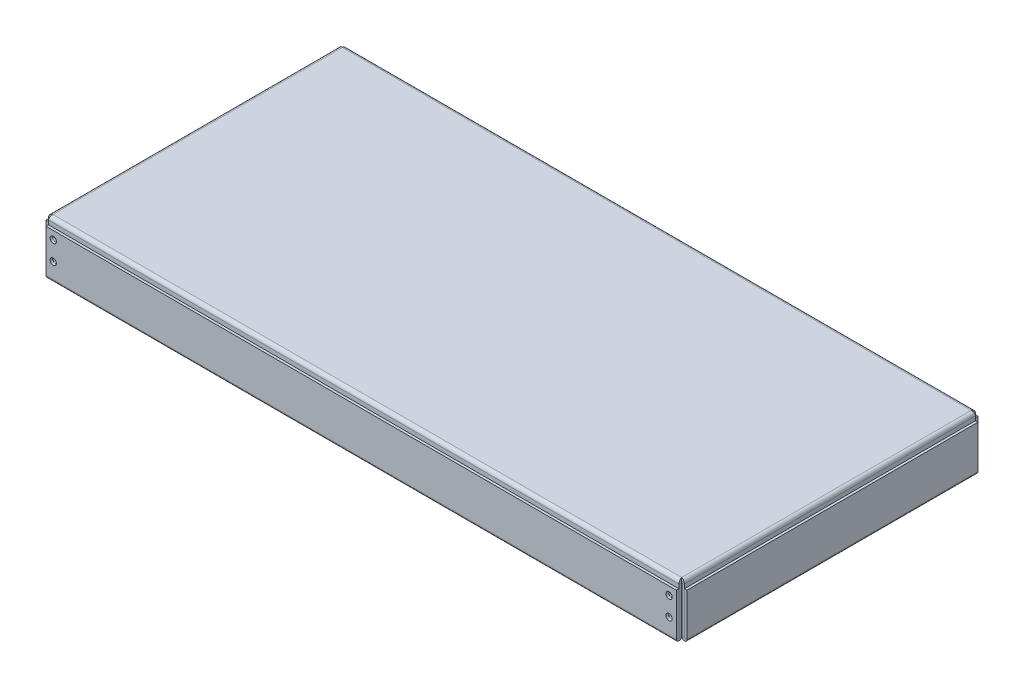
ISO-10303-21;
HEADER;
FILE_DESCRIPTION(('STEP AP214'),'2;1');
FILE_NAME('part.step','',(''),(''),'','','');
FILE_SCHEMA(('AUTOMOTIVE_DESIGN { 1 0 10303 214 1 1 1 1 }'));
ENDSEC;
DATA;
#1=APPLICATION_CONTEXT('core data for automotive mechanical design processes');
#2=APPLICATION_PROTOCOL_DEFINITION('international standard','automotive_design',2000,#1);
#3=PRODUCT_CONTEXT('',#1,'mechanical');
#4=PRODUCT('Part','Part','',(#3));
#5=PRODUCT_RELATED_PRODUCT_CATEGORY('part','',(#4));
#6=PRODUCT_DEFINITION_FORMATION('','',#4);
#7=PRODUCT_DEFINITION_CONTEXT('part definition',#1,'design');
#8=PRODUCT_DEFINITION('design','',#6,#7);
#9=PRODUCT_DEFINITION_SHAPE('','',#8);
#10=(LENGTH_UNIT() NAMED_UNIT(*) SI_UNIT(.MILLI.,.METRE.));
#11=(NAMED_UNIT(*) PLANE_ANGLE_UNIT() SI_UNIT($,.RADIAN.));
#12=(NAMED_UNIT(*) SI_UNIT($,.STERADIAN.) SOLID_ANGLE_UNIT());
#13=UNCERTAINTY_MEASURE_WITH_UNIT(LENGTH_MEASURE(1.E-05),#10,'distance_accuracy_value','');
#14=(GEOMETRIC_REPRESENTATION_CONTEXT(3) GLOBAL_UNCERTAINTY_ASSIGNED_CONTEXT((#13)) GLOBAL_UNIT_ASSIGNED_CONTEXT((#10,
#11,#12)) REPRESENTATION_CONTEXT('',''));
#15=CARTESIAN_POINT('',(0.,0.,0.));
#16=DIRECTION('',(0.,0.,1.));
#17=DIRECTION('',(1.,0.,0.));
#18=AXIS2_PLACEMENT_3D('',#15,#16,#17);
#19=CARTESIAN_POINT('',(-3533.2924,-50.8000000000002,147.2184));
#20=DIRECTION('',(0.,0.,-1.));
#21=DIRECTION('',(0.,1.,0.));
#22=AXIS2_PLACEMENT_3D('',#19,#20,#21);
#23=PLANE('',#22);
#24=CARTESIAN_POINT('',(-311.150000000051,-13.3349999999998,147.218399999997));
#25=DIRECTION('',(0.,0.,-1.));
#26=DIRECTION('',(0.,1.,0.));
#27=AXIS2_PLACEMENT_3D('',#24,#25,#26);
#28=CIRCLE('',#27,3.17499999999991);
#29=CARTESIAN_POINT('',(-311.150000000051,-10.1599999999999,147.218399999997));
#30=VERTEX_POINT('',#29);
#31=EDGE_CURVE('E498',#30,#30,#28,.F.);
#32=ORIENTED_EDGE('',*,*,#31,.T.);
#33=EDGE_LOOP('',(#32));
#34=FACE_BOUND('',#33,.T.);
#35=CARTESIAN_POINT('',(311.150000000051,-32.385,147.218399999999));
#36=DIRECTION('',(0.,0.,-1.));
#37=DIRECTION('',(0.,1.,0.));
#38=AXIS2_PLACEMENT_3D('',#35,#36,#37);
#39=CIRCLE('',#38,3.17499999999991);
#40=CARTESIAN_POINT('',(311.150000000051,-29.2100000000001,147.218399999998));
#41=VERTEX_POINT('',#40);
#42=EDGE_CURVE('E517',#41,#41,#39,.T.);
#43=ORIENTED_EDGE('',*,*,#42,.F.);
#44=EDGE_LOOP('',(#43));
#45=FACE_BOUND('',#44,.T.);
#46=CARTESIAN_POINT('',(311.150000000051,-13.3349999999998,147.218399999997));
#47=DIRECTION('',(0.,0.,-1.));
#48=DIRECTION('',(0.,1.,0.));
#49=AXIS2_PLACEMENT_3D('',#46,#47,#48);
#50=CIRCLE('',#49,3.17499999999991);
#51=CARTESIAN_POINT('',(311.150000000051,-10.1599999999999,147.218399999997));
#52=VERTEX_POINT('',#51);
#53=EDGE_CURVE('E536',#52,#52,#50,.T.);
#54=ORIENTED_EDGE('',*,*,#53,.F.);
#55=EDGE_LOOP('',(#54));
#56=FACE_BOUND('',#55,.T.);
#57=DIRECTION('',(1.,0.,0.));
#58=VECTOR('',#57,1.);
#59=CARTESIAN_POINT('',(318.488794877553,-48.2092000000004,147.2184));
#60=LINE('',#59,#58);
#61=CARTESIAN_POINT('',(318.488794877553,-48.2092000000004,147.2184));
#62=VERTEX_POINT('',#61);
#63=CARTESIAN_POINT('',(-318.488794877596,-48.2092000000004,147.2184));
#64=VERTEX_POINT('',#63);
#65=EDGE_CURVE('E684',#62,#64,#60,.F.);
#66=ORIENTED_EDGE('',*,*,#65,.T.);
#67=DIRECTION('',(0.,1.,0.));
#68=VECTOR('',#67,1.);
#69=CARTESIAN_POINT('',(-318.488794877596,-50.8000000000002,147.2184));
#70=LINE('',#69,#68);
#71=CARTESIAN_POINT('',(-318.488794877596,-0.999999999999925,147.218399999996));
#72=VERTEX_POINT('',#71);
#73=EDGE_CURVE('E447',#64,#72,#70,.T.);
#74=ORIENTED_EDGE('',*,*,#73,.T.);
#75=DIRECTION('',(1.,0.,0.));
#76=VECTOR('',#75,1.);
#77=CARTESIAN_POINT('',(-3533.2924,-0.999999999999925,147.218399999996));
#78=LINE('',#77,#76);
#79=CARTESIAN_POINT('',(318.488794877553,-0.999999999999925,147.218399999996));
#80=VERTEX_POINT('',#79);
#81=EDGE_CURVE('E445',#72,#80,#78,.T.);
#82=ORIENTED_EDGE('',*,*,#81,.T.);
#83=DIRECTION('',(0.,1.,0.));
#84=VECTOR('',#83,1.);
#85=CARTESIAN_POINT('',(318.488794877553,-50.8000000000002,147.2184));
#86=LINE('',#85,#84);
#87=EDGE_CURVE('E450',#80,#62,#86,.F.);
#88=ORIENTED_EDGE('',*,*,#87,.T.);
#89=EDGE_LOOP('',(#66,#74,#82,#88));
#90=FACE_BOUND('',#89,.T.);
#91=CARTESIAN_POINT('',(-311.150000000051,-32.385,147.218399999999));
#92=DIRECTION('',(0.,0.,-1.));
#93=DIRECTION('',(0.,1.,0.));
#94=AXIS2_PLACEMENT_3D('',#91,#92,#93);
#95=CIRCLE('',#94,3.17499999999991);
#96=CARTESIAN_POINT('',(-311.150000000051,-29.2100000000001,147.218399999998));
#97=VERTEX_POINT('',#96);
#98=EDGE_CURVE('E485',#97,#97,#95,.F.);
#99=ORIENTED_EDGE('',*,*,#98,.T.);
#100=EDGE_LOOP('',(#99));
#101=FACE_BOUND('',#100,.T.);
#102=ADVANCED_FACE('F40',(#34,#45,#56,#90,#101),#23,.T.);
#103=CARTESIAN_POINT('',(-3533.2924,-50.8,149.7584));
#104=DIRECTION('',(0.,0.,-1.));
#105=DIRECTION('',(0.,1.,0.));
#106=AXIS2_PLACEMENT_3D('',#103,#104,#105);
#107=PLANE('',#106);
#108=CARTESIAN_POINT('',(-311.150000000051,-13.3349999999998,149.758399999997));
#109=DIRECTION('',(0.,0.,-1.));
#110=DIRECTION('',(0.,1.,0.));
#111=AXIS2_PLACEMENT_3D('',#108,#109,#110);
#112=CIRCLE('',#111,3.17499999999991);
#113=CARTESIAN_POINT('',(-311.150000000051,-10.1599999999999,149.758399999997));
#114=VERTEX_POINT('',#113);
#115=EDGE_CURVE('E495',#114,#114,#112,.F.);
#116=ORIENTED_EDGE('',*,*,#115,.F.);
#117=EDGE_LOOP('',(#116));
#118=FACE_BOUND('',#117,.T.);
#119=CARTESIAN_POINT('',(311.150000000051,-32.385,149.758399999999));
#120=DIRECTION('',(0.,0.,-1.));
#121=DIRECTION('',(0.,1.,0.));
#122=AXIS2_PLACEMENT_3D('',#119,#120,#121);
#123=CIRCLE('',#122,3.17499999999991);
#124=CARTESIAN_POINT('',(311.150000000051,-29.2100000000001,149.758399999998));
#125=VERTEX_POINT('',#124);
#126=EDGE_CURVE('E514',#125,#125,#123,.T.);
#127=ORIENTED_EDGE('',*,*,#126,.T.);
#128=EDGE_LOOP('',(#127));
#129=FACE_BOUND('',#128,.T.);
#130=CARTESIAN_POINT('',(311.150000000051,-13.3349999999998,149.758399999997));
#131=DIRECTION('',(0.,0.,-1.));
#132=DIRECTION('',(0.,1.,0.));
#133=AXIS2_PLACEMENT_3D('',#130,#131,#132);
#134=CIRCLE('',#133,3.17499999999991);
#135=CARTESIAN_POINT('',(311.150000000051,-10.1599999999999,149.758399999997));
#136=VERTEX_POINT('',#135);
#137=EDGE_CURVE('E533',#136,#136,#134,.T.);
#138=ORIENTED_EDGE('',*,*,#137,.T.);
#139=EDGE_LOOP('',(#138));
#140=FACE_BOUND('',#139,.T.);
#141=DIRECTION('',(0.,1.,0.));
#142=VECTOR('',#141,1.);
#143=CARTESIAN_POINT('',(-318.488794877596,-50.8,149.7584));
#144=LINE('',#143,#142);
#145=CARTESIAN_POINT('',(-318.488794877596,-48.2092,149.7584));
#146=VERTEX_POINT('',#145);
#147=CARTESIAN_POINT('',(-318.488794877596,-0.999999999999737,149.758399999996));
#148=VERTEX_POINT('',#147);
#149=EDGE_CURVE('E455',#146,#148,#144,.T.);
#150=ORIENTED_EDGE('',*,*,#149,.F.);
#151=DIRECTION('',(1.,0.,0.));
#152=VECTOR('',#151,1.);
#153=CARTESIAN_POINT('',(318.488794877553,-48.2092,149.7584));
#154=LINE('',#153,#152);
#155=CARTESIAN_POINT('',(318.488794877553,-48.2092,149.7584));
#156=VERTEX_POINT('',#155);
#157=EDGE_CURVE('E697',#156,#146,#154,.F.);
#158=ORIENTED_EDGE('',*,*,#157,.F.);
#159=DIRECTION('',(0.,1.,0.));
#160=VECTOR('',#159,1.);
#161=CARTESIAN_POINT('',(318.488794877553,-50.8,149.7584));
#162=LINE('',#161,#160);
#163=CARTESIAN_POINT('',(318.48879487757,-0.999999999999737,149.758399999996));
#164=VERTEX_POINT('',#163);
#165=EDGE_CURVE('E448',#164,#156,#162,.F.);
#166=ORIENTED_EDGE('',*,*,#165,.F.);
#167=DIRECTION('',(1.,0.,0.));
#168=VECTOR('',#167,1.);
#169=CARTESIAN_POINT('',(-3533.2924,-0.999999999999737,149.758399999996));
#170=LINE('',#169,#168);
#171=EDGE_CURVE('E442',#148,#164,#170,.T.);
#172=ORIENTED_EDGE('',*,*,#171,.F.);
#173=EDGE_LOOP('',(#150,#158,#166,#172));
#174=FACE_BOUND('',#173,.T.);
#175=CARTESIAN_POINT('',(-311.150000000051,-32.385,149.758399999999));
#176=DIRECTION('',(0.,0.,-1.));
#177=DIRECTION('',(0.,1.,0.));
#178=AXIS2_PLACEMENT_3D('',#175,#176,#177);
#179=CIRCLE('',#178,3.17499999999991);
#180=CARTESIAN_POINT('',(-311.150000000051,-29.2100000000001,149.758399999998));
#181=VERTEX_POINT('',#180);
#182=EDGE_CURVE('E911',#181,#181,#179,.F.);
#183=ORIENTED_EDGE('',*,*,#182,.F.);
#184=EDGE_LOOP('',(#183));
#185=FACE_BOUND('',#184,.T.);
#186=ADVANCED_FACE('F796',(#118,#129,#140,#174,#185),#107,.F.);
#187=CARTESIAN_POINT('',(3533.2924,-50.8000000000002,-147.218399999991));
#188=DIRECTION('',(0.,0.,1.));
#189=DIRECTION('',(0.,1.,0.));
#190=AXIS2_PLACEMENT_3D('',#187,#188,#189);
#191=PLANE('',#190);
#192=CARTESIAN_POINT('',(-311.150000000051,-13.3349999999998,-147.218400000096));
#193=DIRECTION('',(0.,0.,1.));
#194=DIRECTION('',(0.,-1.,0.));
#195=AXIS2_PLACEMENT_3D('',#192,#193,#194);
#196=CIRCLE('',#195,3.17499999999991);
#197=CARTESIAN_POINT('',(-311.150000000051,-16.5099999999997,-147.218400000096));
#198=VERTEX_POINT('',#197);
#199=EDGE_CURVE('E492',#198,#198,#196,.F.);
#200=ORIENTED_EDGE('',*,*,#199,.T.);
#201=EDGE_LOOP('',(#200));
#202=FACE_BOUND('',#201,.T.);
#203=CARTESIAN_POINT('',(311.150000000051,-32.385,-147.21840000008));
#204=DIRECTION('',(0.,0.,1.));
#205=DIRECTION('',(0.,-1.,0.));
#206=AXIS2_PLACEMENT_3D('',#203,#204,#205);
#207=CIRCLE('',#206,3.17499999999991);
#208=CARTESIAN_POINT('',(311.150000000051,-35.5599999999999,-147.21840000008));
#209=VERTEX_POINT('',#208);
#210=EDGE_CURVE('E511',#209,#209,#207,.T.);
#211=ORIENTED_EDGE('',*,*,#210,.F.);
#212=EDGE_LOOP('',(#211));
#213=FACE_BOUND('',#212,.T.);
#214=CARTESIAN_POINT('',(311.150000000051,-13.3349999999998,-147.218400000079));
#215=DIRECTION('',(0.,0.,1.));
#216=DIRECTION('',(0.,-1.,0.));
#217=AXIS2_PLACEMENT_3D('',#214,#215,#216);
#218=CIRCLE('',#217,3.17499999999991);
#219=CARTESIAN_POINT('',(311.150000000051,-16.5099999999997,-147.218400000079));
#220=VERTEX_POINT('',#219);
#221=EDGE_CURVE('E530',#220,#220,#218,.T.);
#222=ORIENTED_EDGE('',*,*,#221,.F.);
#223=EDGE_LOOP('',(#222));
#224=FACE_BOUND('',#223,.T.);
#225=DIRECTION('',(-1.,0.,0.));
#226=VECTOR('',#225,1.);
#227=CARTESIAN_POINT('',(-318.488794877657,-48.2092000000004,-147.218400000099));
#228=LINE('',#227,#226);
#229=CARTESIAN_POINT('',(-318.488794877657,-48.2092000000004,-147.218400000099));
#230=VERTEX_POINT('',#229);
#231=CARTESIAN_POINT('',(318.488794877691,-48.2092000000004,-147.218400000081));
#232=VERTEX_POINT('',#231);
#233=EDGE_CURVE('E576',#230,#232,#228,.F.);
#234=ORIENTED_EDGE('',*,*,#233,.T.);
#235=DIRECTION('',(0.,1.,0.));
#236=VECTOR('',#235,1.);
#237=CARTESIAN_POINT('',(318.488794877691,-50.8000000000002,-147.218400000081));
#238=LINE('',#237,#236);
#239=CARTESIAN_POINT('',(318.488794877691,-0.999999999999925,-147.218400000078));
#240=VERTEX_POINT('',#239);
#241=EDGE_CURVE('E361',#232,#240,#238,.T.);
#242=ORIENTED_EDGE('',*,*,#241,.T.);
#243=DIRECTION('',(-1.,0.,0.));
#244=VECTOR('',#243,1.);
#245=CARTESIAN_POINT('',(3533.2924,-0.999999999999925,-147.218399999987));
#246=LINE('',#245,#244);
#247=CARTESIAN_POINT('',(-318.488794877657,-0.999999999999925,-147.218400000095));
#248=VERTEX_POINT('',#247);
#249=EDGE_CURVE('E351',#240,#248,#246,.T.);
#250=ORIENTED_EDGE('',*,*,#249,.T.);
#251=DIRECTION('',(0.,1.,0.));
#252=VECTOR('',#251,1.);
#253=CARTESIAN_POINT('',(-318.488794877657,-50.8000000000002,-147.218400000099));
#254=LINE('',#253,#252);
#255=EDGE_CURVE('E358',#248,#230,#254,.F.);
#256=ORIENTED_EDGE('',*,*,#255,.T.);
#257=EDGE_LOOP('',(#234,#242,#250,#256));
#258=FACE_BOUND('',#257,.T.);
#259=CARTESIAN_POINT('',(-311.150000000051,-32.385,-147.218400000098));
#260=DIRECTION('',(0.,0.,1.));
#261=DIRECTION('',(0.,-1.,0.));
#262=AXIS2_PLACEMENT_3D('',#259,#260,#261);
#263=CIRCLE('',#262,3.17499999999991);
#264=CARTESIAN_POINT('',(-311.150000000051,-35.5599999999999,-147.218400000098));
#265=VERTEX_POINT('',#264);
#266=EDGE_CURVE('E909',#265,#265,#263,.F.);
#267=ORIENTED_EDGE('',*,*,#266,.T.);
#268=EDGE_LOOP('',(#267));
#269=FACE_BOUND('',#268,.T.);
#270=ADVANCED_FACE('F802',(#202,#213,#224,#258,#269),#191,.T.);
#271=CARTESIAN_POINT('',(3533.2924,-50.8,-149.758399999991));
#272=DIRECTION('',(0.,0.,1.));
#273=DIRECTION('',(0.,1.,0.));
#274=AXIS2_PLACEMENT_3D('',#271,#272,#273);
#275=PLANE('',#274);
#276=CARTESIAN_POINT('',(-311.150000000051,-13.3349999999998,-149.758400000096));
#277=DIRECTION('',(0.,0.,1.));
#278=DIRECTION('',(0.,-1.,0.));
#279=AXIS2_PLACEMENT_3D('',#276,#277,#278);
#280=CIRCLE('',#279,3.17499999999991);
#281=CARTESIAN_POINT('',(-311.150000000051,-16.5099999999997,-149.758400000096));
#282=VERTEX_POINT('',#281);
#283=EDGE_CURVE('E477',#282,#282,#280,.F.);
#284=ORIENTED_EDGE('',*,*,#283,.F.);
#285=EDGE_LOOP('',(#284));
#286=FACE_BOUND('',#285,.T.);
#287=CARTESIAN_POINT('',(311.150000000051,-32.385,-149.75840000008));
#288=DIRECTION('',(0.,0.,1.));
#289=DIRECTION('',(0.,-1.,0.));
#290=AXIS2_PLACEMENT_3D('',#287,#288,#289);
#291=CIRCLE('',#290,3.17499999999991);
#292=CARTESIAN_POINT('',(311.150000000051,-35.5599999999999,-149.75840000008));
#293=VERTEX_POINT('',#292);
#294=EDGE_CURVE('E508',#293,#293,#291,.T.);
#295=ORIENTED_EDGE('',*,*,#294,.T.);
#296=EDGE_LOOP('',(#295));
#297=FACE_BOUND('',#296,.T.);
#298=CARTESIAN_POINT('',(311.150000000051,-13.3349999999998,-149.758400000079));
#299=DIRECTION('',(0.,0.,1.));
#300=DIRECTION('',(0.,-1.,0.));
#301=AXIS2_PLACEMENT_3D('',#298,#299,#300);
#302=CIRCLE('',#301,3.17499999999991);
#303=CARTESIAN_POINT('',(311.150000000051,-16.5099999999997,-149.758400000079));
#304=VERTEX_POINT('',#303);
#305=EDGE_CURVE('E527',#304,#304,#302,.T.);
#306=ORIENTED_EDGE('',*,*,#305,.T.);
#307=EDGE_LOOP('',(#306));
#308=FACE_BOUND('',#307,.T.);
#309=DIRECTION('',(0.,1.,0.));
#310=VECTOR('',#309,1.);
#311=CARTESIAN_POINT('',(318.488794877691,-50.8,-149.758400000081));
#312=LINE('',#311,#310);
#313=CARTESIAN_POINT('',(318.488794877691,-48.2092,-149.758400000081));
#314=VERTEX_POINT('',#313);
#315=CARTESIAN_POINT('',(318.488794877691,-0.999999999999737,-149.758400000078));
#316=VERTEX_POINT('',#315);
#317=EDGE_CURVE('E326',#314,#316,#312,.T.);
#318=ORIENTED_EDGE('',*,*,#317,.F.);
#319=DIRECTION('',(-1.,0.,0.));
#320=VECTOR('',#319,1.);
#321=CARTESIAN_POINT('',(-318.488794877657,-48.2092,-149.758400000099));
#322=LINE('',#321,#320);
#323=CARTESIAN_POINT('',(-318.488794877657,-48.2092,-149.758400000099));
#324=VERTEX_POINT('',#323);
#325=EDGE_CURVE('E589',#324,#314,#322,.F.);
#326=ORIENTED_EDGE('',*,*,#325,.F.);
#327=DIRECTION('',(0.,1.,0.));
#328=VECTOR('',#327,1.);
#329=CARTESIAN_POINT('',(-318.488794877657,-50.8,-149.758400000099));
#330=LINE('',#329,#328);
#331=CARTESIAN_POINT('',(-318.488794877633,-0.999999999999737,-149.758400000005));
#332=VERTEX_POINT('',#331);
#333=EDGE_CURVE('E348',#332,#324,#330,.F.);
#334=ORIENTED_EDGE('',*,*,#333,.F.);
#335=DIRECTION('',(-1.,0.,0.));
#336=VECTOR('',#335,1.);
#337=CARTESIAN_POINT('',(3533.2924,-0.999999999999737,-149.758399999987));
#338=LINE('',#337,#336);
#339=EDGE_CURVE('E353',#316,#332,#338,.T.);
#340=ORIENTED_EDGE('',*,*,#339,.F.);
#341=EDGE_LOOP('',(#318,#326,#334,#340));
#342=FACE_BOUND('',#341,.T.);
#343=CARTESIAN_POINT('',(-311.150000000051,-32.385,-149.758400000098));
#344=DIRECTION('',(0.,0.,1.));
#345=DIRECTION('',(0.,-1.,0.));
#346=AXIS2_PLACEMENT_3D('',#343,#344,#345);
#347=CIRCLE('',#346,3.17499999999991);
#348=CARTESIAN_POINT('',(-311.150000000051,-35.5599999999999,-149.758400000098));
#349=VERTEX_POINT('',#348);
#350=EDGE_CURVE('E897',#349,#349,#347,.F.);
#351=ORIENTED_EDGE('',*,*,#350,.F.);
#352=EDGE_LOOP('',(#351));
#353=FACE_BOUND('',#352,.T.);
#354=ADVANCED_FACE('F841',(#286,#297,#308,#342,#353),#275,.F.);
#355=CARTESIAN_POINT('',(-2.1316282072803E-11,-26.6445999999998,152.399999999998));
#356=DIRECTION('',(0.,0.,1.));
#357=DIRECTION('',(0.,-1.,0.));
#358=AXIS2_PLACEMENT_3D('',#355,#356,#357);
#359=PLANE('',#358);
#360=CARTESIAN_POINT('',(-311.150000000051,-13.3349999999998,152.399999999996));
#361=DIRECTION('',(0.,0.,-1.));
#362=DIRECTION('',(-1.,0.,0.));
#363=AXIS2_PLACEMENT_3D('',#360,#361,#362);
#364=CIRCLE('',#363,3.17499999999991);
#365=CARTESIAN_POINT('',(-314.325000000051,-13.3349999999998,152.399999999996));
#366=VERTEX_POINT('',#365);
#367=EDGE_CURVE('E480',#366,#366,#364,.T.);
#368=ORIENTED_EDGE('',*,*,#367,.T.);
#369=EDGE_LOOP('',(#368));
#370=FACE_BOUND('',#369,.T.);
#371=CARTESIAN_POINT('',(311.150000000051,-32.385,152.399999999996));
#372=DIRECTION('',(0.,0.,1.));
#373=DIRECTION('',(1.,0.,0.));
#374=AXIS2_PLACEMENT_3D('',#371,#372,#373);
#375=CIRCLE('',#374,3.17499999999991);
#376=CARTESIAN_POINT('',(314.325000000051,-32.385,152.399999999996));
#377=VERTEX_POINT('',#376);
#378=EDGE_CURVE('E501',#377,#377,#375,.T.);
#379=ORIENTED_EDGE('',*,*,#378,.F.);
#380=EDGE_LOOP('',(#379));
#381=FACE_BOUND('',#380,.T.);
#382=CARTESIAN_POINT('',(311.150000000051,-13.3349999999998,152.399999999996));
#383=DIRECTION('',(0.,0.,1.));
#384=DIRECTION('',(1.,0.,0.));
#385=AXIS2_PLACEMENT_3D('',#382,#383,#384);
#386=CIRCLE('',#385,3.17499999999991);
#387=CARTESIAN_POINT('',(314.325000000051,-13.3349999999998,152.399999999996));
#388=VERTEX_POINT('',#387);
#389=EDGE_CURVE('E520',#388,#388,#386,.T.);
#390=ORIENTED_EDGE('',*,*,#389,.F.);
#391=EDGE_LOOP('',(#390));
#392=FACE_BOUND('',#391,.T.);
#393=DIRECTION('',(1.,0.,0.));
#394=VECTOR('',#393,1.);
#395=CARTESIAN_POINT('',(-2.1316282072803E-11,-5.0799999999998,152.399999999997));
#396=LINE('',#395,#394);
#397=CARTESIAN_POINT('',(-318.488794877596,-5.0799999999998,152.399999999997));
#398=VERTEX_POINT('',#397);
#399=CARTESIAN_POINT('',(318.488794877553,-5.0799999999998,152.399999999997));
#400=VERTEX_POINT('',#399);
#401=EDGE_CURVE('E705',#398,#400,#396,.T.);
#402=ORIENTED_EDGE('',*,*,#401,.F.);
#403=DIRECTION('',(0.,1.,0.));
#404=VECTOR('',#403,1.);
#405=CARTESIAN_POINT('',(-318.488794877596,-26.6445999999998,152.399999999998));
#406=LINE('',#405,#404);
#407=CARTESIAN_POINT('',(-318.488794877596,-48.2091999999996,152.4));
#408=VERTEX_POINT('',#407);
#409=EDGE_CURVE('E715',#408,#398,#406,.T.);
#410=ORIENTED_EDGE('',*,*,#409,.F.);
#411=DIRECTION('',(-1.,0.,0.));
#412=VECTOR('',#411,1.);
#413=CARTESIAN_POINT('',(-2.1316282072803E-11,-48.2091999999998,152.4));
#414=LINE('',#413,#412);
#415=CARTESIAN_POINT('',(318.488794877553,-48.2091999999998,152.4));
#416=VERTEX_POINT('',#415);
#417=EDGE_CURVE('E712',#416,#408,#414,.T.);
#418=ORIENTED_EDGE('',*,*,#417,.F.);
#419=DIRECTION('',(0.,-1.,0.));
#420=VECTOR('',#419,1.);
#421=CARTESIAN_POINT('',(318.488794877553,-26.6445999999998,152.399999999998));
#422=LINE('',#421,#420);
#423=EDGE_CURVE('E709',#400,#416,#422,.T.);
#424=ORIENTED_EDGE('',*,*,#423,.F.);
#425=EDGE_LOOP('',(#402,#410,#418,#424));
#426=FACE_BOUND('',#425,.T.);
#427=CARTESIAN_POINT('',(-311.150000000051,-32.385,152.399999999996));
#428=DIRECTION('',(0.,0.,-1.));
#429=DIRECTION('',(-1.,0.,0.));
#430=AXIS2_PLACEMENT_3D('',#427,#428,#429);
#431=CIRCLE('',#430,3.17499999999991);
#432=CARTESIAN_POINT('',(-314.325000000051,-32.385,152.399999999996));
#433=VERTEX_POINT('',#432);
#434=EDGE_CURVE('E900',#433,#433,#431,.T.);
#435=ORIENTED_EDGE('',*,*,#434,.T.);
#436=EDGE_LOOP('',(#435));
#437=FACE_BOUND('',#436,.T.);
#438=ADVANCED_FACE('F1096',(#370,#381,#392,#426,#437),#359,.T.);
#439=CARTESIAN_POINT('',(-2.1316282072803E-11,-26.6446,149.859999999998));
#440=DIRECTION('',(0.,0.,1.));
#441=DIRECTION('',(0.,-1.,0.));
#442=AXIS2_PLACEMENT_3D('',#439,#440,#441);
#443=PLANE('',#442);
#444=CARTESIAN_POINT('',(-311.150000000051,-13.3349999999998,149.859999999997));
#445=DIRECTION('',(0.,0.,1.));
#446=DIRECTION('',(0.,-1.,0.));
#447=AXIS2_PLACEMENT_3D('',#444,#445,#446);
#448=CIRCLE('',#447,3.17499999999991);
#449=CARTESIAN_POINT('',(-311.150000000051,-16.5099999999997,149.859999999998));
#450=VERTEX_POINT('',#449);
#451=EDGE_CURVE('E472',#450,#450,#448,.F.);
#452=ORIENTED_EDGE('',*,*,#451,.F.);
#453=EDGE_LOOP('',(#452));
#454=FACE_BOUND('',#453,.T.);
#455=CARTESIAN_POINT('',(311.150000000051,-32.385,149.859999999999));
#456=DIRECTION('',(0.,0.,1.));
#457=DIRECTION('',(0.,-1.,0.));
#458=AXIS2_PLACEMENT_3D('',#455,#456,#457);
#459=CIRCLE('',#458,3.17499999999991);
#460=CARTESIAN_POINT('',(311.150000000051,-35.5599999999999,149.859999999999));
#461=VERTEX_POINT('',#460);
#462=EDGE_CURVE('E468',#461,#461,#459,.T.);
#463=ORIENTED_EDGE('',*,*,#462,.T.);
#464=EDGE_LOOP('',(#463));
#465=FACE_BOUND('',#464,.T.);
#466=CARTESIAN_POINT('',(311.150000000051,-13.3349999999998,149.859999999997));
#467=DIRECTION('',(0.,0.,1.));
#468=DIRECTION('',(0.,-1.,0.));
#469=AXIS2_PLACEMENT_3D('',#466,#467,#468);
#470=CIRCLE('',#469,3.17499999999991);
#471=CARTESIAN_POINT('',(311.150000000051,-16.5099999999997,149.859999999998));
#472=VERTEX_POINT('',#471);
#473=EDGE_CURVE('E464',#472,#472,#470,.T.);
#474=ORIENTED_EDGE('',*,*,#473,.T.);
#475=EDGE_LOOP('',(#474));
#476=FACE_BOUND('',#475,.T.);
#477=DIRECTION('',(1.,0.,0.));
#478=VECTOR('',#477,1.);
#479=CARTESIAN_POINT('',(-2.1316282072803E-11,-5.07999999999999,149.859999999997));
#480=LINE('',#479,#478);
#481=CARTESIAN_POINT('',(-318.488794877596,-5.07999999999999,149.859999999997));
#482=VERTEX_POINT('',#481);
#483=CARTESIAN_POINT('',(318.488794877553,-5.07999999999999,149.859999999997));
#484=VERTEX_POINT('',#483);
#485=EDGE_CURVE('E718',#482,#484,#480,.T.);
#486=ORIENTED_EDGE('',*,*,#485,.T.);
#487=DIRECTION('',(0.,-1.,0.));
#488=VECTOR('',#487,1.);
#489=CARTESIAN_POINT('',(318.488794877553,-26.6446,149.859999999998));
#490=LINE('',#489,#488);
#491=CARTESIAN_POINT('',(318.488794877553,-48.2092,149.86));
#492=VERTEX_POINT('',#491);
#493=EDGE_CURVE('E721',#484,#492,#490,.T.);
#494=ORIENTED_EDGE('',*,*,#493,.T.);
#495=DIRECTION('',(1.,0.,0.));
#496=VECTOR('',#495,1.);
#497=CARTESIAN_POINT('',(-2.1316282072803E-11,-48.2092,149.86));
#498=LINE('',#497,#496);
#499=CARTESIAN_POINT('',(-318.488794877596,-48.2092,149.86));
#500=VERTEX_POINT('',#499);
#501=EDGE_CURVE('E724',#492,#500,#498,.F.);
#502=ORIENTED_EDGE('',*,*,#501,.T.);
#503=DIRECTION('',(0.,-1.,0.));
#504=VECTOR('',#503,1.);
#505=CARTESIAN_POINT('',(-318.488794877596,-26.6446,149.859999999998));
#506=LINE('',#505,#504);
#507=EDGE_CURVE('E702',#500,#482,#506,.F.);
#508=ORIENTED_EDGE('',*,*,#507,.T.);
#509=EDGE_LOOP('',(#486,#494,#502,#508));
#510=FACE_BOUND('',#509,.T.);
#511=CARTESIAN_POINT('',(-311.150000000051,-32.385,149.859999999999));
#512=DIRECTION('',(0.,0.,1.));
#513=DIRECTION('',(0.,-1.,0.));
#514=AXIS2_PLACEMENT_3D('',#511,#512,#513);
#515=CIRCLE('',#514,3.17499999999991);
#516=CARTESIAN_POINT('',(-311.150000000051,-35.5599999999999,149.859999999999));
#517=VERTEX_POINT('',#516);
#518=EDGE_CURVE('E894',#517,#517,#515,.F.);
#519=ORIENTED_EDGE('',*,*,#518,.F.);
#520=EDGE_LOOP('',(#519));
#521=FACE_BOUND('',#520,.T.);
#522=ADVANCED_FACE('F1107',(#454,#465,#476,#510,#521),#443,.F.);
#523=CARTESIAN_POINT('',(1.69494982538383E-11,-26.6445999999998,-152.400000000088));
#524=DIRECTION('',(0.,0.,-1.));
#525=DIRECTION('',(0.,1.,0.));
#526=AXIS2_PLACEMENT_3D('',#523,#524,#525);
#527=PLANE('',#526);
#528=CARTESIAN_POINT('',(-311.150000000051,-13.3349999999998,-152.400000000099));
#529=DIRECTION('',(0.,0.,-1.));
#530=DIRECTION('',(-1.,0.,0.));
#531=AXIS2_PLACEMENT_3D('',#528,#529,#530);
#532=CIRCLE('',#531,3.17499999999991);
#533=CARTESIAN_POINT('',(-314.325000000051,-13.3349999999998,-152.400000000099));
#534=VERTEX_POINT('',#533);
#535=EDGE_CURVE('E473',#534,#534,#532,.T.);
#536=ORIENTED_EDGE('',*,*,#535,.F.);
#537=EDGE_LOOP('',(#536));
#538=FACE_BOUND('',#537,.T.);
#539=CARTESIAN_POINT('',(311.150000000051,-32.385,-152.400000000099));
#540=DIRECTION('',(0.,0.,1.));
#541=DIRECTION('',(1.,0.,0.));
#542=AXIS2_PLACEMENT_3D('',#539,#540,#541);
#543=CIRCLE('',#542,3.17499999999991);
#544=CARTESIAN_POINT('',(314.325000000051,-32.385,-152.400000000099));
#545=VERTEX_POINT('',#544);
#546=EDGE_CURVE('E469',#545,#545,#543,.T.);
#547=ORIENTED_EDGE('',*,*,#546,.T.);
#548=EDGE_LOOP('',(#547));
#549=FACE_BOUND('',#548,.T.);
#550=CARTESIAN_POINT('',(311.150000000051,-13.3349999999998,-152.400000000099));
#551=DIRECTION('',(0.,0.,1.));
#552=DIRECTION('',(1.,0.,0.));
#553=AXIS2_PLACEMENT_3D('',#550,#551,#552);
#554=CIRCLE('',#553,3.17499999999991);
#555=CARTESIAN_POINT('',(314.325000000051,-13.3349999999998,-152.400000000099));
#556=VERTEX_POINT('',#555);
#557=EDGE_CURVE('E465',#556,#556,#554,.T.);
#558=ORIENTED_EDGE('',*,*,#557,.T.);
#559=EDGE_LOOP('',(#558));
#560=FACE_BOUND('',#559,.T.);
#561=DIRECTION('',(-1.,0.,0.));
#562=VECTOR('',#561,1.);
#563=CARTESIAN_POINT('',(1.69494982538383E-11,-5.0799999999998,-152.400000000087));
#564=LINE('',#563,#562);
#565=CARTESIAN_POINT('',(318.488794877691,-5.0799999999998,-152.400000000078));
#566=VERTEX_POINT('',#565);
#567=CARTESIAN_POINT('',(-318.488794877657,-5.0799999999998,-152.400000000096));
#568=VERTEX_POINT('',#567);
#569=EDGE_CURVE('E597',#566,#568,#564,.T.);
#570=ORIENTED_EDGE('',*,*,#569,.F.);
#571=DIRECTION('',(0.,1.,0.));
#572=VECTOR('',#571,1.);
#573=CARTESIAN_POINT('',(318.488794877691,-26.6445999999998,-152.400000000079));
#574=LINE('',#573,#572);
#575=CARTESIAN_POINT('',(318.488794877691,-48.2091999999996,-152.400000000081));
#576=VERTEX_POINT('',#575);
#577=EDGE_CURVE('E607',#576,#566,#574,.T.);
#578=ORIENTED_EDGE('',*,*,#577,.F.);
#579=DIRECTION('',(1.,0.,0.));
#580=VECTOR('',#579,1.);
#581=CARTESIAN_POINT('',(1.69494982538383E-11,-48.2091999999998,-152.40000000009));
#582=LINE('',#581,#580);
#583=CARTESIAN_POINT('',(-318.488794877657,-48.2091999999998,-152.400000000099));
#584=VERTEX_POINT('',#583);
#585=EDGE_CURVE('E604',#584,#576,#582,.T.);
#586=ORIENTED_EDGE('',*,*,#585,.F.);
#587=DIRECTION('',(0.,-1.,0.));
#588=VECTOR('',#587,1.);
#589=CARTESIAN_POINT('',(-318.488794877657,-26.6445999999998,-152.400000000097));
#590=LINE('',#589,#588);
#591=EDGE_CURVE('E601',#568,#584,#590,.T.);
#592=ORIENTED_EDGE('',*,*,#591,.F.);
#593=EDGE_LOOP('',(#570,#578,#586,#592));
#594=FACE_BOUND('',#593,.T.);
#595=CARTESIAN_POINT('',(-311.150000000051,-32.385,-152.400000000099));
#596=DIRECTION('',(0.,0.,-1.));
#597=DIRECTION('',(-1.,0.,0.));
#598=AXIS2_PLACEMENT_3D('',#595,#596,#597);
#599=CIRCLE('',#598,3.17499999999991);
#600=CARTESIAN_POINT('',(-314.325000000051,-32.385,-152.400000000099));
#601=VERTEX_POINT('',#600);
#602=EDGE_CURVE('E895',#601,#601,#599,.T.);
#603=ORIENTED_EDGE('',*,*,#602,.F.);
#604=EDGE_LOOP('',(#603));
#605=FACE_BOUND('',#604,.T.);
#606=ADVANCED_FACE('F877',(#538,#549,#560,#594,#605),#527,.T.);
#607=CARTESIAN_POINT('',(1.6878240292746E-11,-26.6446,-149.860000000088));
#608=DIRECTION('',(0.,0.,-1.));
#609=DIRECTION('',(0.,1.,0.));
#610=AXIS2_PLACEMENT_3D('',#607,#608,#609);
#611=PLANE('',#610);
#612=CARTESIAN_POINT('',(-311.150000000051,-13.3349999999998,-149.860000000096));
#613=DIRECTION('',(0.,0.,-1.));
#614=DIRECTION('',(0.,1.,0.));
#615=AXIS2_PLACEMENT_3D('',#612,#613,#614);
#616=CIRCLE('',#615,3.17499999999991);
#617=CARTESIAN_POINT('',(-311.150000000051,-10.1599999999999,-149.860000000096));
#618=VERTEX_POINT('',#617);
#619=EDGE_CURVE('E470',#618,#618,#616,.F.);
#620=ORIENTED_EDGE('',*,*,#619,.F.);
#621=EDGE_LOOP('',(#620));
#622=FACE_BOUND('',#621,.T.);
#623=CARTESIAN_POINT('',(311.150000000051,-32.385,-149.86000000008));
#624=DIRECTION('',(0.,0.,-1.));
#625=DIRECTION('',(0.,1.,0.));
#626=AXIS2_PLACEMENT_3D('',#623,#624,#625);
#627=CIRCLE('',#626,3.17499999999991);
#628=CARTESIAN_POINT('',(311.150000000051,-29.2100000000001,-149.86000000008));
#629=VERTEX_POINT('',#628);
#630=EDGE_CURVE('E466',#629,#629,#627,.T.);
#631=ORIENTED_EDGE('',*,*,#630,.T.);
#632=EDGE_LOOP('',(#631));
#633=FACE_BOUND('',#632,.T.);
#634=CARTESIAN_POINT('',(311.150000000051,-13.3349999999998,-149.860000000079));
#635=DIRECTION('',(0.,0.,-1.));
#636=DIRECTION('',(0.,1.,0.));
#637=AXIS2_PLACEMENT_3D('',#634,#635,#636);
#638=CIRCLE('',#637,3.17499999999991);
#639=CARTESIAN_POINT('',(311.150000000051,-10.1599999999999,-149.860000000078));
#640=VERTEX_POINT('',#639);
#641=EDGE_CURVE('E461',#640,#640,#638,.T.);
#642=ORIENTED_EDGE('',*,*,#641,.T.);
#643=EDGE_LOOP('',(#642));
#644=FACE_BOUND('',#643,.T.);
#645=DIRECTION('',(1.,0.,0.));
#646=VECTOR('',#645,1.);
#647=CARTESIAN_POINT('',(1.6878240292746E-11,-5.07999999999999,-149.860000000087));
#648=LINE('',#647,#646);
#649=CARTESIAN_POINT('',(318.488794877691,-5.07999999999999,-149.860000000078));
#650=VERTEX_POINT('',#649);
#651=CARTESIAN_POINT('',(-318.488794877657,-5.07999999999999,-149.860000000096));
#652=VERTEX_POINT('',#651);
#653=EDGE_CURVE('E610',#650,#652,#648,.F.);
#654=ORIENTED_EDGE('',*,*,#653,.T.);
#655=DIRECTION('',(0.,1.,0.));
#656=VECTOR('',#655,1.);
#657=CARTESIAN_POINT('',(-318.488794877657,-26.6446,-149.860000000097));
#658=LINE('',#657,#656);
#659=CARTESIAN_POINT('',(-318.488794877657,-48.2092,-149.860000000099));
#660=VERTEX_POINT('',#659);
#661=EDGE_CURVE('E613',#652,#660,#658,.F.);
#662=ORIENTED_EDGE('',*,*,#661,.T.);
#663=DIRECTION('',(1.,0.,0.));
#664=VECTOR('',#663,1.);
#665=CARTESIAN_POINT('',(1.6878240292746E-11,-48.2092,-149.86000000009));
#666=LINE('',#665,#664);
#667=CARTESIAN_POINT('',(318.488794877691,-48.2092,-149.860000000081));
#668=VERTEX_POINT('',#667);
#669=EDGE_CURVE('E616',#660,#668,#666,.T.);
#670=ORIENTED_EDGE('',*,*,#669,.T.);
#671=DIRECTION('',(0.,1.,0.));
#672=VECTOR('',#671,1.);
#673=CARTESIAN_POINT('',(318.488794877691,-26.6446,-149.860000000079));
#674=LINE('',#673,#672);
#675=EDGE_CURVE('E594',#668,#650,#674,.T.);
#676=ORIENTED_EDGE('',*,*,#675,.T.);
#677=EDGE_LOOP('',(#654,#662,#670,#676));
#678=FACE_BOUND('',#677,.T.);
#679=CARTESIAN_POINT('',(-311.150000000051,-32.385,-149.860000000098));
#680=DIRECTION('',(0.,0.,-1.));
#681=DIRECTION('',(0.,1.,0.));
#682=AXIS2_PLACEMENT_3D('',#679,#680,#681);
#683=CIRCLE('',#682,3.17499999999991);
#684=CARTESIAN_POINT('',(-311.150000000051,-29.2100000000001,-149.860000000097));
#685=VERTEX_POINT('',#684);
#686=EDGE_CURVE('E44',#685,#685,#683,.F.);
#687=ORIENTED_EDGE('',*,*,#686,.F.);
#688=EDGE_LOOP('',(#687));
#689=FACE_BOUND('',#688,.T.);
#690=ADVANCED_FACE('F886',(#622,#633,#644,#678,#689),#611,.F.);
#691=CARTESIAN_POINT('',(-321.208400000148,-50.8,147.038794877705));
#692=DIRECTION('',(0.,0.,-1.));
#693=DIRECTION('',(0.,1.,0.));
#694=AXIS2_PLACEMENT_3D('',#691,#692,#693);
#695=PLANE('',#694);
#696=DIRECTION('',(0.,1.,0.));
#697=VECTOR('',#696,1.);
#698=CARTESIAN_POINT('',(-321.208400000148,-50.8,147.038794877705));
#699=LINE('',#698,#697);
#700=CARTESIAN_POINT('',(-321.208400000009,-0.999999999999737,147.038794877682));
#701=VERTEX_POINT('',#700);
#702=CARTESIAN_POINT('',(-321.208400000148,-48.2092,147.038794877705));
#703=VERTEX_POINT('',#702);
#704=EDGE_CURVE('E331',#701,#703,#699,.F.);
#705=ORIENTED_EDGE('',*,*,#704,.T.);
#706=DIRECTION('',(1.,-1.36592399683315E-13,0.));
#707=VECTOR('',#706,1.);
#708=CARTESIAN_POINT('',(-321.208400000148,-48.2092,147.038794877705));
#709=LINE('',#708,#707);
#710=CARTESIAN_POINT('',(-318.668400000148,-48.2092000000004,147.038794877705));
#711=VERTEX_POINT('',#710);
#712=EDGE_CURVE('E289',#703,#711,#709,.T.);
#713=ORIENTED_EDGE('',*,*,#712,.T.);
#714=DIRECTION('',(0.,1.,0.));
#715=VECTOR('',#714,1.);
#716=CARTESIAN_POINT('',(-318.668400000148,-50.8000000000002,147.038794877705));
#717=LINE('',#716,#715);
#718=CARTESIAN_POINT('',(-318.668400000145,-0.999999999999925,147.038794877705));
#719=VERTEX_POINT('',#718);
#720=EDGE_CURVE('E306',#719,#711,#717,.F.);
#721=ORIENTED_EDGE('',*,*,#720,.F.);
#722=DIRECTION('',(1.,0.,0.));
#723=VECTOR('',#722,1.);
#724=CARTESIAN_POINT('',(-321.208400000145,-0.999999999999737,147.038794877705));
#725=LINE('',#724,#723);
#726=EDGE_CURVE('E335',#701,#719,#725,.T.);
#727=ORIENTED_EDGE('',*,*,#726,.F.);
#728=EDGE_LOOP('',(#705,#713,#721,#727));
#729=FACE_BOUND('',#728,.T.);
#730=ADVANCED_FACE('F767',(#729),#695,.F.);
#731=CARTESIAN_POINT('',(-318.488794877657,-50.8,-149.758400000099));
#732=DIRECTION('',(1.,0.,0.));
#733=DIRECTION('',(0.,1.,0.));
#734=AXIS2_PLACEMENT_3D('',#731,#732,#733);
#735=PLANE('',#734);
#736=ORIENTED_EDGE('',*,*,#333,.T.);
#737=DIRECTION('',(0.,-1.36592399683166E-13,1.));
#738=VECTOR('',#737,1.);
#739=CARTESIAN_POINT('',(-318.488794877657,-48.2092,-149.758400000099));
#740=LINE('',#739,#738);
#741=EDGE_CURVE('E583',#324,#230,#740,.T.);
#742=ORIENTED_EDGE('',*,*,#741,.T.);
#743=ORIENTED_EDGE('',*,*,#255,.F.);
#744=DIRECTION('',(0.,0.,1.));
#745=VECTOR('',#744,1.);
#746=CARTESIAN_POINT('',(-318.488794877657,-0.999999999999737,-149.758400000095));
#747=LINE('',#746,#745);
#748=EDGE_CURVE('E340',#332,#248,#747,.T.);
#749=ORIENTED_EDGE('',*,*,#748,.F.);
#750=EDGE_LOOP('',(#736,#742,#743,#749));
#751=FACE_BOUND('',#750,.T.);
#752=ADVANCED_FACE('F859',(#751),#735,.F.);
#753=CARTESIAN_POINT('',(321.208400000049,-50.8,-147.038794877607));
#754=DIRECTION('',(0.,0.,1.));
#755=DIRECTION('',(0.,1.,0.));
#756=AXIS2_PLACEMENT_3D('',#753,#754,#755);
#757=PLANE('',#756);
#758=DIRECTION('',(0.,1.,0.));
#759=VECTOR('',#758,1.);
#760=CARTESIAN_POINT('',(321.208400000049,-50.8,-147.038794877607));
#761=LINE('',#760,#759);
#762=CARTESIAN_POINT('',(321.2084,-0.999999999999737,-147.03879487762));
#763=VERTEX_POINT('',#762);
#764=CARTESIAN_POINT('',(321.208400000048,-48.2092,-147.038794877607));
#765=VERTEX_POINT('',#764);
#766=EDGE_CURVE('E389',#763,#765,#761,.F.);
#767=ORIENTED_EDGE('',*,*,#766,.T.);
#768=DIRECTION('',(-1.,-1.36592399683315E-13,0.));
#769=VECTOR('',#768,1.);
#770=CARTESIAN_POINT('',(321.208400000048,-48.2092,-147.038794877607));
#771=LINE('',#770,#769);
#772=CARTESIAN_POINT('',(318.668400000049,-48.2092000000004,-147.038794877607));
#773=VERTEX_POINT('',#772);
#774=EDGE_CURVE('E637',#765,#773,#771,.T.);
#775=ORIENTED_EDGE('',*,*,#774,.T.);
#776=DIRECTION('',(0.,1.,0.));
#777=VECTOR('',#776,1.);
#778=CARTESIAN_POINT('',(318.668400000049,-50.8000000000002,-147.038794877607));
#779=LINE('',#778,#777);
#780=CARTESIAN_POINT('',(318.668400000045,-0.999999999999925,-147.038794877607));
#781=VERTEX_POINT('',#780);
#782=EDGE_CURVE('E399',#781,#773,#779,.F.);
#783=ORIENTED_EDGE('',*,*,#782,.F.);
#784=DIRECTION('',(-1.,0.,0.));
#785=VECTOR('',#784,1.);
#786=CARTESIAN_POINT('',(321.208400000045,-0.999999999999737,-147.038794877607));
#787=LINE('',#786,#785);
#788=EDGE_CURVE('E381',#763,#781,#787,.T.);
#789=ORIENTED_EDGE('',*,*,#788,.F.);
#790=EDGE_LOOP('',(#767,#775,#783,#789));
#791=FACE_BOUND('',#790,.T.);
#792=ADVANCED_FACE('F820',(#791),#757,.F.);
#793=CARTESIAN_POINT('',(318.488794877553,-50.8,149.7584));
#794=DIRECTION('',(-1.,0.,0.));
#795=DIRECTION('',(0.,1.,0.));
#796=AXIS2_PLACEMENT_3D('',#793,#794,#795);
#797=PLANE('',#796);
#798=ORIENTED_EDGE('',*,*,#165,.T.);
#799=DIRECTION('',(0.,-1.36592399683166E-13,-1.));
#800=VECTOR('',#799,1.);
#801=CARTESIAN_POINT('',(318.488794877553,-48.2092,149.7584));
#802=LINE('',#801,#800);
#803=EDGE_CURVE('E691',#156,#62,#802,.T.);
#804=ORIENTED_EDGE('',*,*,#803,.T.);
#805=ORIENTED_EDGE('',*,*,#87,.F.);
#806=DIRECTION('',(0.,0.,-1.));
#807=VECTOR('',#806,1.);
#808=CARTESIAN_POINT('',(318.488794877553,-0.999999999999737,149.758399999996));
#809=LINE('',#808,#807);
#810=EDGE_CURVE('E49',#164,#80,#809,.T.);
#811=ORIENTED_EDGE('',*,*,#810,.F.);
#812=EDGE_LOOP('',(#798,#804,#805,#811));
#813=FACE_BOUND('',#812,.T.);
#814=ADVANCED_FACE('F818',(#813),#797,.F.);
#815=CARTESIAN_POINT('',(-321.2084,0.,149.7584));
#816=DIRECTION('',(0.,1.,0.));
#817=DIRECTION('',(0.,0.,1.));
#818=AXIS2_PLACEMENT_3D('',#815,#816,#817);
#819=PLANE('',#818);
#820=DIRECTION('',(1.,0.,0.));
#821=VECTOR('',#820,1.);
#822=CARTESIAN_POINT('',(-3533.29239999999,0.,146.218399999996));
#823=LINE('',#822,#821);
#824=CARTESIAN_POINT('',(-317.668400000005,0.,146.218399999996));
#825=VERTEX_POINT('',#824);
#826=CARTESIAN_POINT('',(317.668399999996,0.,146.218400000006));
#827=VERTEX_POINT('',#826);
#828=EDGE_CURVE('E422',#825,#827,#823,.T.);
#829=ORIENTED_EDGE('',*,*,#828,.F.);
#830=DIRECTION('',(0.,0.,1.));
#831=VECTOR('',#830,1.);
#832=CARTESIAN_POINT('',(-317.668399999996,0.,-149.75839999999));
#833=LINE('',#832,#831);
#834=CARTESIAN_POINT('',(-317.668399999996,0.,-146.21839999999));
#835=VERTEX_POINT('',#834);
#836=EDGE_CURVE('E338',#835,#825,#833,.T.);
#837=ORIENTED_EDGE('',*,*,#836,.F.);
#838=DIRECTION('',(-1.,0.,0.));
#839=VECTOR('',#838,1.);
#840=CARTESIAN_POINT('',(321.208399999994,0.,-146.218399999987));
#841=LINE('',#840,#839);
#842=CARTESIAN_POINT('',(317.66840000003,0.,-146.218399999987));
#843=VERTEX_POINT('',#842);
#844=EDGE_CURVE('E343',#843,#835,#841,.T.);
#845=ORIENTED_EDGE('',*,*,#844,.F.);
#846=DIRECTION('',(0.,0.,-1.));
#847=VECTOR('',#846,1.);
#848=CARTESIAN_POINT('',(317.668399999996,0.,149.75839999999));
#849=LINE('',#848,#847);
#850=EDGE_CURVE('E384',#827,#843,#849,.T.);
#851=ORIENTED_EDGE('',*,*,#850,.F.);
#852=EDGE_LOOP('',(#829,#837,#845,#851));
#853=FACE_BOUND('',#852,.T.);
#854=ADVANCED_FACE('F42',(#853),#819,.F.);
#855=CARTESIAN_POINT('',(-321.2084,2.54,149.7584));
#856=DIRECTION('',(0.,1.,0.));
#857=DIRECTION('',(0.,0.,1.));
#858=AXIS2_PLACEMENT_3D('',#855,#856,#857);
#859=PLANE('',#858);
#860=DIRECTION('',(0.,0.,1.));
#861=VECTOR('',#860,1.);
#862=CARTESIAN_POINT('',(-317.668399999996,2.54,-149.758399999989));
#863=LINE('',#862,#861);
#864=CARTESIAN_POINT('',(-317.668399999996,2.54,-146.218399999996));
#865=VERTEX_POINT('',#864);
#866=CARTESIAN_POINT('',(-317.668400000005,2.54,146.218399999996));
#867=VERTEX_POINT('',#866);
#868=EDGE_CURVE('E316',#865,#867,#863,.T.);
#869=ORIENTED_EDGE('',*,*,#868,.T.);
#870=DIRECTION('',(1.,0.,0.));
#871=VECTOR('',#870,1.);
#872=CARTESIAN_POINT('',(-3533.29239999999,2.54,146.218399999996));
#873=LINE('',#872,#871);
#874=CARTESIAN_POINT('',(317.668399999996,2.54,146.218399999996));
#875=VERTEX_POINT('',#874);
#876=EDGE_CURVE('E397',#867,#875,#873,.T.);
#877=ORIENTED_EDGE('',*,*,#876,.T.);
#878=DIRECTION('',(0.,0.,-1.));
#879=VECTOR('',#878,1.);
#880=CARTESIAN_POINT('',(317.668399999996,2.54,149.758399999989));
#881=LINE('',#880,#879);
#882=CARTESIAN_POINT('',(317.668399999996,2.54,-146.218399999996));
#883=VERTEX_POINT('',#882);
#884=EDGE_CURVE('E409',#875,#883,#881,.T.);
#885=ORIENTED_EDGE('',*,*,#884,.T.);
#886=DIRECTION('',(-1.,0.,0.));
#887=VECTOR('',#886,1.);
#888=CARTESIAN_POINT('',(321.208399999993,2.54,-146.218399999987));
#889=LINE('',#888,#887);
#890=EDGE_CURVE('E368',#883,#865,#889,.T.);
#891=ORIENTED_EDGE('',*,*,#890,.T.);
#892=EDGE_LOOP('',(#869,#877,#885,#891));
#893=FACE_BOUND('',#892,.T.);
#894=ADVANCED_FACE('F816',(#893),#859,.T.);
#895=CARTESIAN_POINT('',(-318.488794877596,-50.8,149.7584));
#896=DIRECTION('',(-1.,0.,0.));
#897=DIRECTION('',(0.,1.,0.));
#898=AXIS2_PLACEMENT_3D('',#895,#896,#897);
#899=PLANE('',#898);
#900=DIRECTION('',(0.,-1.36592399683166E-13,-1.));
#901=VECTOR('',#900,1.);
#902=CARTESIAN_POINT('',(-318.488794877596,-48.2092,149.7584));
#903=LINE('',#902,#901);
#904=EDGE_CURVE('E700',#146,#64,#903,.T.);
#905=ORIENTED_EDGE('',*,*,#904,.F.);
#906=ORIENTED_EDGE('',*,*,#149,.T.);
#907=DIRECTION('',(0.,0.,-1.));
#908=VECTOR('',#907,1.);
#909=CARTESIAN_POINT('',(-318.488794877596,-0.999999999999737,149.758399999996));
#910=LINE('',#909,#908);
#911=EDGE_CURVE('E11',#148,#72,#910,.T.);
#912=ORIENTED_EDGE('',*,*,#911,.T.);
#913=ORIENTED_EDGE('',*,*,#73,.F.);
#914=EDGE_LOOP('',(#905,#906,#912,#913));
#915=FACE_BOUND('',#914,.T.);
#916=ADVANCED_FACE('F812',(#915),#899,.T.);
#917=CARTESIAN_POINT('',(-316.848005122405,-1.,145.218399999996));
#918=CARTESIAN_POINT('',(-316.848005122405,-1.,144.37173333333));
#919=CARTESIAN_POINT('',(-316.848005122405,-1.,143.525066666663));
#920=CARTESIAN_POINT('',(-316.848005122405,-1.,142.678399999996));
#921=CARTESIAN_POINT('',(-316.848005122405,-3.,145.218399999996));
#922=CARTESIAN_POINT('',(-316.848005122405,-4.69333333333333,144.37173333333));
#923=CARTESIAN_POINT('',(-316.848005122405,-6.38666666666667,143.525066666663));
#924=CARTESIAN_POINT('',(-316.848005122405,-8.08,142.678399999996));
#925=CARTESIAN_POINT('',(-318.488794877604,-3.,147.218399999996));
#926=CARTESIAN_POINT('',(-318.488794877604,-4.69333333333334,148.065066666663));
#927=CARTESIAN_POINT('',(-318.488794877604,-6.38666666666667,148.91173333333));
#928=CARTESIAN_POINT('',(-318.488794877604,-8.08,149.758399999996));
#929=CARTESIAN_POINT('',(-318.488794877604,-1.,147.218399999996));
#930=CARTESIAN_POINT('',(-318.488794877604,-1.,148.065066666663));
#931=CARTESIAN_POINT('',(-318.488794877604,-1.,148.91173333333));
#932=CARTESIAN_POINT('',(-318.488794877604,-1.,149.758399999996));
#933=CARTESIAN_POINT('',(-318.488794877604,0.999999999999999,147.218399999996));
#934=CARTESIAN_POINT('',(-318.488794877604,2.69333333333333,148.065066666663));
#935=CARTESIAN_POINT('',(-318.488794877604,4.38666666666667,148.91173333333));
#936=CARTESIAN_POINT('',(-318.488794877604,6.08,149.758399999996));
#937=CARTESIAN_POINT('',(-316.848005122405,0.999999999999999,145.218399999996));
#938=CARTESIAN_POINT('',(-316.848005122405,2.69333333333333,144.37173333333));
#939=CARTESIAN_POINT('',(-316.848005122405,4.38666666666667,143.525066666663));
#940=CARTESIAN_POINT('',(-316.848005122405,6.08,142.678399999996));
#941=CARTESIAN_POINT('',(-316.848005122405,-1.,145.218399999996));
#942=CARTESIAN_POINT('',(-316.848005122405,-1.,144.37173333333));
#943=CARTESIAN_POINT('',(-316.848005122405,-1.,143.525066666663));
#944=CARTESIAN_POINT('',(-316.848005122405,-1.,142.678399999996));
#945=(BOUNDED_SURFACE() B_SPLINE_SURFACE(3,3,((#917,#918,#919,#920),(#921,#922,#923,#924),(#925,
#926,#927,#928),(#929,#930,#931,#932),(#933,#934,#935,#936),(#937,#938,#939,#940),(#941,#942,
#943,#944)),.UNSPECIFIED.,.T.,.F.,.F.) B_SPLINE_SURFACE_WITH_KNOTS((4,3,4),(4,4),(0.,0.5,1.),
(0.,1.),.UNSPECIFIED.) GEOMETRIC_REPRESENTATION_ITEM() RATIONAL_B_SPLINE_SURFACE(((1.,1.,1.,1.),
(0.333333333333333,0.333333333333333,0.333333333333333,0.333333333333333),(0.333333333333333,
0.333333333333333,0.333333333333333,0.333333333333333),(1.,1.,1.,1.),(0.333333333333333,
0.333333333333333,0.333333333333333,0.333333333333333),(0.333333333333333,0.333333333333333,
0.333333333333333,0.333333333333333),(1.,1.,1.,1.))) REPRESENTATION_ITEM('') SURFACE());
#946=CARTESIAN_POINT('',(-317.668400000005,-1.,146.218399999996));
#947=DIRECTION('',(-0.97418144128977,0.,-0.225766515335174));
#948=DIRECTION('',(0.225766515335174,0.,-0.97418144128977));
#949=AXIS2_PLACEMENT_3D('',#946,#947,#948);
#950=ELLIPSE('',#949,3.63381999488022,3.54);
#951=EDGE_CURVE('E435',#148,#867,#950,.T.);
#952=DIRECTION('',(0.,-1.,0.));
#953=VECTOR('',#952,1.);
#954=CARTESIAN_POINT('',(-317.668400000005,2.54,146.218399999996));
#955=LINE('',#954,#953);
#956=EDGE_CURVE('E440',#867,#825,#955,.T.);
#957=CARTESIAN_POINT('',(-317.668400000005,-1.,146.218399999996));
#958=DIRECTION('',(-0.773118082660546,0.,-0.634262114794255));
#959=DIRECTION('',(0.634262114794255,0.,-0.773118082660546));
#960=AXIS2_PLACEMENT_3D('',#957,#958,#959);
#961=ELLIPSE('',#960,1.29346347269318,1.);
#962=EDGE_CURVE('E425',#72,#825,#961,.T.);
#963=ORIENTED_EDGE('',*,*,#911,.F.);
#964=ORIENTED_EDGE('',*,*,#951,.T.);
#965=ORIENTED_EDGE('',*,*,#956,.T.);
#966=ORIENTED_EDGE('',*,*,#962,.F.);
#967=EDGE_LOOP('',(#963,#964,#965,#966));
#968=FACE_BOUND('',#967,.T.);
#969=ADVANCED_FACE('F815',(#968),#945,.F.);
#970=CARTESIAN_POINT('',(318.488794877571,-1.,147.218399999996));
#971=CARTESIAN_POINT('',(318.488794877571,-1.,148.065066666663));
#972=CARTESIAN_POINT('',(318.488794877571,-1.,148.91173333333));
#973=CARTESIAN_POINT('',(318.488794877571,-1.,149.758399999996));
#974=CARTESIAN_POINT('',(318.488794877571,-3.,147.218399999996));
#975=CARTESIAN_POINT('',(318.488794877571,-4.69333333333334,148.065066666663));
#976=CARTESIAN_POINT('',(318.488794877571,-6.38666666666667,148.91173333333));
#977=CARTESIAN_POINT('',(318.488794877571,-8.08,149.758399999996));
#978=CARTESIAN_POINT('',(316.848005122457,-3.,145.218399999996));
#979=CARTESIAN_POINT('',(316.848005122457,-4.69333333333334,144.37173333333));
#980=CARTESIAN_POINT('',(316.848005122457,-6.38666666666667,143.525066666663));
#981=CARTESIAN_POINT('',(316.848005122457,-8.08,142.678399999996));
#982=CARTESIAN_POINT('',(316.848005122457,-1.,145.218399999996));
#983=CARTESIAN_POINT('',(316.848005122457,-1.,144.37173333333));
#984=CARTESIAN_POINT('',(316.848005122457,-1.,143.525066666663));
#985=CARTESIAN_POINT('',(316.848005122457,-1.,142.678399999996));
#986=CARTESIAN_POINT('',(316.848005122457,0.999999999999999,145.218399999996));
#987=CARTESIAN_POINT('',(316.848005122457,2.69333333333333,144.37173333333));
#988=CARTESIAN_POINT('',(316.848005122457,4.38666666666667,143.525066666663));
#989=CARTESIAN_POINT('',(316.848005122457,6.08,142.678399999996));
#990=CARTESIAN_POINT('',(318.488794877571,1.,147.218399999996));
#991=CARTESIAN_POINT('',(318.488794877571,2.69333333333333,148.065066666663));
#992=CARTESIAN_POINT('',(318.488794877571,4.38666666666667,148.91173333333));
#993=CARTESIAN_POINT('',(318.488794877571,6.08,149.758399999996));
#994=CARTESIAN_POINT('',(318.488794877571,-1.,147.218399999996));
#995=CARTESIAN_POINT('',(318.488794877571,-1.,148.065066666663));
#996=CARTESIAN_POINT('',(318.488794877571,-1.,148.91173333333));
#997=CARTESIAN_POINT('',(318.488794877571,-1.,149.758399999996));
#998=(BOUNDED_SURFACE() B_SPLINE_SURFACE(3,3,((#970,#971,#972,#973),(#974,#975,#976,#977),(#978,
#979,#980,#981),(#982,#983,#984,#985),(#986,#987,#988,#989),(#990,#991,#992,#993),(#994,#995,
#996,#997)),.UNSPECIFIED.,.T.,.F.,.F.) B_SPLINE_SURFACE_WITH_KNOTS((4,3,4),(4,4),(0.,0.5,1.),
(0.,1.),.UNSPECIFIED.) GEOMETRIC_REPRESENTATION_ITEM() RATIONAL_B_SPLINE_SURFACE(((1.,1.,1.,1.),
(0.333333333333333,0.333333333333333,0.333333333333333,0.333333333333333),(0.333333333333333,
0.333333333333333,0.333333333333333,0.333333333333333),(1.,1.,1.,1.),(0.333333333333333,
0.333333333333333,0.333333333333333,0.333333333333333),(0.333333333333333,0.333333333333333,
0.333333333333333,0.333333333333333),(1.,1.,1.,1.))) REPRESENTATION_ITEM('') SURFACE());
#999=CARTESIAN_POINT('',(317.668400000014,-1.,146.218399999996));
#1000=DIRECTION('',(0.97418144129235,0.,-0.22576651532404));
#1001=DIRECTION('',(0.22576651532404,0.,0.97418144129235));
#1002=AXIS2_PLACEMENT_3D('',#999,#1000,#1001);
#1003=ELLIPSE('',#1002,3.6338199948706,3.54);
#1004=EDGE_CURVE('E426',#875,#164,#1003,.T.);
#1005=CARTESIAN_POINT('',(317.668400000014,-1.,146.218399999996));
#1006=DIRECTION('',(0.773118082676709,0.,-0.634262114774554));
#1007=DIRECTION('',(0.634262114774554,0.,0.773118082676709));
#1008=AXIS2_PLACEMENT_3D('',#1005,#1006,#1007);
#1009=ELLIPSE('',#1008,1.29346347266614,1.);
#1010=EDGE_CURVE('E429',#827,#80,#1009,.T.);
#1011=DIRECTION('',(0.,-1.,0.));
#1012=VECTOR('',#1011,1.);
#1013=CARTESIAN_POINT('',(317.668400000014,2.54,146.218399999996));
#1014=LINE('',#1013,#1012);
#1015=EDGE_CURVE('E432',#875,#827,#1014,.T.);
#1016=ORIENTED_EDGE('',*,*,#1004,.T.);
#1017=ORIENTED_EDGE('',*,*,#810,.T.);
#1018=ORIENTED_EDGE('',*,*,#1010,.F.);
#1019=ORIENTED_EDGE('',*,*,#1015,.F.);
#1020=EDGE_LOOP('',(#1016,#1017,#1018,#1019));
#1021=FACE_BOUND('',#1020,.T.);
#1022=ADVANCED_FACE('F807',(#1021),#998,.F.);
#1023=CARTESIAN_POINT('',(-3533.29239999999,-1.,146.218399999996));
#1024=DIRECTION('',(1.,0.,0.));
#1025=DIRECTION('',(0.,0.,-1.));
#1026=AXIS2_PLACEMENT_3D('',#1023,#1024,#1025);
#1027=CYLINDRICAL_SURFACE('',#1026,1.);
#1028=ORIENTED_EDGE('',*,*,#828,.T.);
#1029=ORIENTED_EDGE('',*,*,#1010,.T.);
#1030=ORIENTED_EDGE('',*,*,#81,.F.);
#1031=ORIENTED_EDGE('',*,*,#962,.T.);
#1032=EDGE_LOOP('',(#1028,#1029,#1030,#1031));
#1033=FACE_BOUND('',#1032,.T.);
#1034=ADVANCED_FACE('F1681',(#1033),#1027,.F.);
#1035=CARTESIAN_POINT('',(-3533.29239999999,-1.,146.218399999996));
#1036=DIRECTION('',(1.,0.,0.));
#1037=DIRECTION('',(0.,0.,-1.));
#1038=AXIS2_PLACEMENT_3D('',#1035,#1036,#1037);
#1039=CYLINDRICAL_SURFACE('',#1038,3.54);
#1040=ORIENTED_EDGE('',*,*,#876,.F.);
#1041=ORIENTED_EDGE('',*,*,#951,.F.);
#1042=ORIENTED_EDGE('',*,*,#171,.T.);
#1043=ORIENTED_EDGE('',*,*,#1004,.F.);
#1044=EDGE_LOOP('',(#1040,#1041,#1042,#1043));
#1045=FACE_BOUND('',#1044,.T.);
#1046=ADVANCED_FACE('F1671',(#1045),#1039,.T.);
#1047=CARTESIAN_POINT('',(321.208400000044,-50.8,147.038794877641));
#1048=DIRECTION('',(0.,0.,1.));
#1049=DIRECTION('',(0.,1.,0.));
#1050=AXIS2_PLACEMENT_3D('',#1047,#1048,#1049);
#1051=PLANE('',#1050);
#1052=DIRECTION('',(-1.,-1.36592399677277E-13,0.));
#1053=VECTOR('',#1052,1.);
#1054=CARTESIAN_POINT('',(321.208400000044,-48.2092,147.038794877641));
#1055=LINE('',#1054,#1053);
#1056=CARTESIAN_POINT('',(321.208400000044,-48.2092,147.038794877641));
#1057=VERTEX_POINT('',#1056);
#1058=CARTESIAN_POINT('',(318.668400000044,-48.2092000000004,147.038794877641));
#1059=VERTEX_POINT('',#1058);
#1060=EDGE_CURVE('E646',#1057,#1059,#1055,.T.);
#1061=ORIENTED_EDGE('',*,*,#1060,.F.);
#1062=DIRECTION('',(0.,1.,0.));
#1063=VECTOR('',#1062,1.);
#1064=CARTESIAN_POINT('',(321.208400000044,-50.8,147.038794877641));
#1065=LINE('',#1064,#1063);
#1066=CARTESIAN_POINT('',(321.208400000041,-0.999999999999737,147.038794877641));
#1067=VERTEX_POINT('',#1066);
#1068=EDGE_CURVE('E356',#1057,#1067,#1065,.T.);
#1069=ORIENTED_EDGE('',*,*,#1068,.T.);
#1070=DIRECTION('',(-1.,0.,0.));
#1071=VECTOR('',#1070,1.);
#1072=CARTESIAN_POINT('',(321.208400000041,-0.999999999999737,147.038794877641));
#1073=LINE('',#1072,#1071);
#1074=CARTESIAN_POINT('',(318.668400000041,-0.999999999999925,147.038794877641));
#1075=VERTEX_POINT('',#1074);
#1076=EDGE_CURVE('E386',#1067,#1075,#1073,.T.);
#1077=ORIENTED_EDGE('',*,*,#1076,.T.);
#1078=DIRECTION('',(0.,1.,0.));
#1079=VECTOR('',#1078,1.);
#1080=CARTESIAN_POINT('',(318.668400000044,-50.8000000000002,147.038794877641));
#1081=LINE('',#1080,#1079);
#1082=EDGE_CURVE('E402',#1059,#1075,#1081,.T.);
#1083=ORIENTED_EDGE('',*,*,#1082,.F.);
#1084=EDGE_LOOP('',(#1061,#1069,#1077,#1083));
#1085=FACE_BOUND('',#1084,.T.);
#1086=ADVANCED_FACE('F1661',(#1085),#1051,.T.);
#1087=CARTESIAN_POINT('',(318.668399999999,-50.8000000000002,3361.8424));
#1088=DIRECTION('',(-1.,0.,0.));
#1089=DIRECTION('',(0.,1.,0.));
#1090=AXIS2_PLACEMENT_3D('',#1087,#1088,#1089);
#1091=PLANE('',#1090);
#1092=DIRECTION('',(0.,0.,-1.));
#1093=VECTOR('',#1092,1.);
#1094=CARTESIAN_POINT('',(318.668400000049,-48.2092000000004,-147.038794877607));
#1095=LINE('',#1094,#1093);
#1096=EDGE_CURVE('E630',#773,#1059,#1095,.F.);
#1097=ORIENTED_EDGE('',*,*,#1096,.T.);
#1098=ORIENTED_EDGE('',*,*,#1082,.T.);
#1099=DIRECTION('',(0.,0.,-1.));
#1100=VECTOR('',#1099,1.);
#1101=CARTESIAN_POINT('',(318.668399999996,-0.999999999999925,3361.8424));
#1102=LINE('',#1101,#1100);
#1103=EDGE_CURVE('E392',#1075,#781,#1102,.T.);
#1104=ORIENTED_EDGE('',*,*,#1103,.T.);
#1105=ORIENTED_EDGE('',*,*,#782,.T.);
#1106=EDGE_LOOP('',(#1097,#1098,#1104,#1105));
#1107=FACE_BOUND('',#1106,.T.);
#1108=ADVANCED_FACE('F1651',(#1107),#1091,.T.);
#1109=CARTESIAN_POINT('',(321.208399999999,-50.8,3361.8424));
#1110=DIRECTION('',(-1.,0.,0.));
#1111=DIRECTION('',(0.,1.,0.));
#1112=AXIS2_PLACEMENT_3D('',#1109,#1110,#1111);
#1113=PLANE('',#1112);
#1114=ORIENTED_EDGE('',*,*,#1068,.F.);
#1115=DIRECTION('',(0.,0.,-1.));
#1116=VECTOR('',#1115,1.);
#1117=CARTESIAN_POINT('',(321.208400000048,-48.2092,-147.038794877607));
#1118=LINE('',#1117,#1116);
#1119=EDGE_CURVE('E643',#765,#1057,#1118,.F.);
#1120=ORIENTED_EDGE('',*,*,#1119,.F.);
#1121=ORIENTED_EDGE('',*,*,#766,.F.);
#1122=DIRECTION('',(0.,0.,-1.));
#1123=VECTOR('',#1122,1.);
#1124=CARTESIAN_POINT('',(321.208399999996,-0.999999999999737,3361.8424));
#1125=LINE('',#1124,#1123);
#1126=EDGE_CURVE('E394',#1067,#763,#1125,.T.);
#1127=ORIENTED_EDGE('',*,*,#1126,.F.);
#1128=EDGE_LOOP('',(#1114,#1120,#1121,#1127));
#1129=FACE_BOUND('',#1128,.T.);
#1130=ADVANCED_FACE('F1641',(#1129),#1113,.F.);
#1131=CARTESIAN_POINT('',(316.668399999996,-1.,145.398005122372));
#1132=CARTESIAN_POINT('',(315.82173333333,-1.,145.398005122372));
#1133=CARTESIAN_POINT('',(314.975066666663,-1.,145.398005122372));
#1134=CARTESIAN_POINT('',(314.128399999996,-1.,145.398005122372));
#1135=CARTESIAN_POINT('',(316.668399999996,-3.,145.398005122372));
#1136=CARTESIAN_POINT('',(315.82173333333,-4.69333333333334,145.398005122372));
#1137=CARTESIAN_POINT('',(314.975066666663,-6.38666666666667,145.398005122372));
#1138=CARTESIAN_POINT('',(314.128399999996,-8.08,145.398005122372));
#1139=CARTESIAN_POINT('',(318.668399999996,-3.,147.03879487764));
#1140=CARTESIAN_POINT('',(319.515066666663,-4.69333333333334,147.03879487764));
#1141=CARTESIAN_POINT('',(320.36173333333,-6.38666666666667,147.03879487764));
#1142=CARTESIAN_POINT('',(321.208399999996,-8.08,147.03879487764));
#1143=CARTESIAN_POINT('',(318.668399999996,-1.,147.03879487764));
#1144=CARTESIAN_POINT('',(319.515066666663,-1.,147.03879487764));
#1145=CARTESIAN_POINT('',(320.36173333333,-1.,147.03879487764));
#1146=CARTESIAN_POINT('',(321.208399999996,-1.,147.03879487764));
#1147=CARTESIAN_POINT('',(318.668399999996,0.999999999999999,147.03879487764));
#1148=CARTESIAN_POINT('',(319.515066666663,2.69333333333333,147.03879487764));
#1149=CARTESIAN_POINT('',(320.36173333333,4.38666666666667,147.03879487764));
#1150=CARTESIAN_POINT('',(321.208399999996,6.08,147.03879487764));
#1151=CARTESIAN_POINT('',(316.668399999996,0.999999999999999,145.398005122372));
#1152=CARTESIAN_POINT('',(315.82173333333,2.69333333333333,145.398005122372));
#1153=CARTESIAN_POINT('',(314.975066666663,4.38666666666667,145.398005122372));
#1154=CARTESIAN_POINT('',(314.128399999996,6.08,145.398005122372));
#1155=CARTESIAN_POINT('',(316.668399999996,-1.,145.398005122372));
#1156=CARTESIAN_POINT('',(315.82173333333,-1.,145.398005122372));
#1157=CARTESIAN_POINT('',(314.975066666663,-1.,145.398005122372));
#1158=CARTESIAN_POINT('',(314.128399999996,-1.,145.398005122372));
#1159=(BOUNDED_SURFACE() B_SPLINE_SURFACE(3,3,((#1131,#1132,#1133,#1134),(#1135,#1136,#1137,
#1138),(#1139,#1140,#1141,#1142),(#1143,#1144,#1145,#1146),(#1147,#1148,#1149,#1150),(#1151,
#1152,#1153,#1154),(#1155,#1156,#1157,#1158)),.UNSPECIFIED.,.T.,.F.,
.F.) B_SPLINE_SURFACE_WITH_KNOTS((4,3,4),(4,4),(0.,0.5,1.),(0.,1.),
.UNSPECIFIED.) GEOMETRIC_REPRESENTATION_ITEM() RATIONAL_B_SPLINE_SURFACE(((1.,1.,1.,1.),
(0.333333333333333,0.333333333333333,0.333333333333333,0.333333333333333),(0.333333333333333,
0.333333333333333,0.333333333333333,0.333333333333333),(1.,1.,1.,1.),(0.333333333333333,
0.333333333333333,0.333333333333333,0.333333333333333),(0.333333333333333,0.333333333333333,
0.333333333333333,0.333333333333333),(1.,1.,1.,1.))) REPRESENTATION_ITEM('') SURFACE());
#1160=CARTESIAN_POINT('',(317.668399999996,-1.,146.218400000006));
#1161=DIRECTION('',(-0.225766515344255,0.,0.974181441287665));
#1162=DIRECTION('',(-0.974181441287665,0.,-0.225766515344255));
#1163=AXIS2_PLACEMENT_3D('',#1160,#1161,#1162);
#1164=ELLIPSE('',#1163,3.63381999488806,3.54);
#1165=EDGE_CURVE('E404',#1067,#875,#1164,.T.);
#1166=CARTESIAN_POINT('',(317.668399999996,-1.,146.218400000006));
#1167=DIRECTION('',(-0.634262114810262,0.,0.773118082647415));
#1168=DIRECTION('',(-0.773118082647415,0.,-0.634262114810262));
#1169=AXIS2_PLACEMENT_3D('',#1166,#1167,#1168);
#1170=ELLIPSE('',#1169,1.29346347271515,1.);
#1171=EDGE_CURVE('E398',#1075,#827,#1170,.T.);
#1172=ORIENTED_EDGE('',*,*,#1076,.F.);
#1173=ORIENTED_EDGE('',*,*,#1165,.T.);
#1174=ORIENTED_EDGE('',*,*,#1015,.T.);
#1175=ORIENTED_EDGE('',*,*,#1171,.F.);
#1176=EDGE_LOOP('',(#1172,#1173,#1174,#1175));
#1177=FACE_BOUND('',#1176,.T.);
#1178=ADVANCED_FACE('F1631',(#1177),#1159,.F.);
#1179=CARTESIAN_POINT('',(318.6684,-1.,-147.03879487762));
#1180=CARTESIAN_POINT('',(319.515066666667,-1.,-147.03879487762));
#1181=CARTESIAN_POINT('',(320.361733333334,-1.,-147.03879487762));
#1182=CARTESIAN_POINT('',(321.2084,-1.,-147.03879487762));
#1183=CARTESIAN_POINT('',(318.6684,-3.,-147.03879487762));
#1184=CARTESIAN_POINT('',(319.515066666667,-4.69333333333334,-147.03879487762));
#1185=CARTESIAN_POINT('',(320.361733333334,-6.38666666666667,-147.03879487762));
#1186=CARTESIAN_POINT('',(321.2084,-8.08,-147.03879487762));
#1187=CARTESIAN_POINT('',(316.6684,-3.,-145.398005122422));
#1188=CARTESIAN_POINT('',(315.821733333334,-4.69333333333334,-145.398005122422));
#1189=CARTESIAN_POINT('',(314.975066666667,-6.38666666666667,-145.398005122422));
#1190=CARTESIAN_POINT('',(314.1284,-8.08,-145.398005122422));
#1191=CARTESIAN_POINT('',(316.6684,-1.,-145.398005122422));
#1192=CARTESIAN_POINT('',(315.821733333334,-1.,-145.398005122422));
#1193=CARTESIAN_POINT('',(314.975066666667,-1.,-145.398005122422));
#1194=CARTESIAN_POINT('',(314.1284,-1.,-145.398005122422));
#1195=CARTESIAN_POINT('',(316.6684,0.999999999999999,-145.398005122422));
#1196=CARTESIAN_POINT('',(315.821733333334,2.69333333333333,-145.398005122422));
#1197=CARTESIAN_POINT('',(314.975066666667,4.38666666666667,-145.398005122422));
#1198=CARTESIAN_POINT('',(314.1284,6.08,-145.398005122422));
#1199=CARTESIAN_POINT('',(318.6684,0.999999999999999,-147.03879487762));
#1200=CARTESIAN_POINT('',(319.515066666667,2.69333333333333,-147.03879487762));
#1201=CARTESIAN_POINT('',(320.361733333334,4.38666666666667,-147.03879487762));
#1202=CARTESIAN_POINT('',(321.2084,6.08,-147.03879487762));
#1203=CARTESIAN_POINT('',(318.6684,-1.,-147.03879487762));
#1204=CARTESIAN_POINT('',(319.515066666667,-1.,-147.03879487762));
#1205=CARTESIAN_POINT('',(320.361733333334,-1.,-147.03879487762));
#1206=CARTESIAN_POINT('',(321.2084,-1.,-147.03879487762));
#1207=(BOUNDED_SURFACE() B_SPLINE_SURFACE(3,3,((#1179,#1180,#1181,#1182),(#1183,#1184,#1185,
#1186),(#1187,#1188,#1189,#1190),(#1191,#1192,#1193,#1194),(#1195,#1196,#1197,#1198),(#1199,
#1200,#1201,#1202),(#1203,#1204,#1205,#1206)),.UNSPECIFIED.,.T.,.F.,
.F.) B_SPLINE_SURFACE_WITH_KNOTS((4,3,4),(4,4),(0.,0.5,1.),(0.,1.),
.UNSPECIFIED.) GEOMETRIC_REPRESENTATION_ITEM() RATIONAL_B_SPLINE_SURFACE(((1.,1.,1.,1.),
(0.333333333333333,0.333333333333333,0.333333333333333,0.333333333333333),(0.333333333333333,
0.333333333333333,0.333333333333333,0.333333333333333),(1.,1.,1.,1.),(0.333333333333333,
0.333333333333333,0.333333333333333,0.333333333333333),(0.333333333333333,0.333333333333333,
0.333333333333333,0.333333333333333),(1.,1.,1.,1.))) REPRESENTATION_ITEM('') SURFACE());
#1208=CARTESIAN_POINT('',(317.6684,-1.,-146.218400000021));
#1209=DIRECTION('',(-0.225766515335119,0.,-0.974181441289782));
#1210=DIRECTION('',(0.974181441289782,0.,-0.225766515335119));
#1211=AXIS2_PLACEMENT_3D('',#1208,#1209,#1210);
#1212=ELLIPSE('',#1211,3.63381999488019,3.54);
#1213=EDGE_CURVE('E385',#883,#763,#1212,.T.);
#1214=CARTESIAN_POINT('',(317.6684,-1.,-146.218400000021));
#1215=DIRECTION('',(-0.634262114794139,0.,-0.773118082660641));
#1216=DIRECTION('',(0.773118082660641,0.,-0.634262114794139));
#1217=AXIS2_PLACEMENT_3D('',#1214,#1215,#1216);
#1218=ELLIPSE('',#1217,1.29346347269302,1.);
#1219=EDGE_CURVE('E415',#843,#781,#1218,.T.);
#1220=DIRECTION('',(0.,-1.,0.));
#1221=VECTOR('',#1220,1.);
#1222=CARTESIAN_POINT('',(317.6684,2.54,-146.218400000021));
#1223=LINE('',#1222,#1221);
#1224=EDGE_CURVE('E406',#883,#843,#1223,.T.);
#1225=ORIENTED_EDGE('',*,*,#1213,.T.);
#1226=ORIENTED_EDGE('',*,*,#788,.T.);
#1227=ORIENTED_EDGE('',*,*,#1219,.F.);
#1228=ORIENTED_EDGE('',*,*,#1224,.F.);
#1229=EDGE_LOOP('',(#1225,#1226,#1227,#1228));
#1230=FACE_BOUND('',#1229,.T.);
#1231=ADVANCED_FACE('F1621',(#1230),#1207,.F.);
#1232=CARTESIAN_POINT('',(317.668399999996,-1.,149.75839999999));
#1233=DIRECTION('',(0.,0.,-1.));
#1234=DIRECTION('',(-1.,0.,0.));
#1235=AXIS2_PLACEMENT_3D('',#1232,#1233,#1234);
#1236=CYLINDRICAL_SURFACE('',#1235,1.);
#1237=ORIENTED_EDGE('',*,*,#850,.T.);
#1238=ORIENTED_EDGE('',*,*,#1219,.T.);
#1239=ORIENTED_EDGE('',*,*,#1103,.F.);
#1240=ORIENTED_EDGE('',*,*,#1171,.T.);
#1241=EDGE_LOOP('',(#1237,#1238,#1239,#1240));
#1242=FACE_BOUND('',#1241,.T.);
#1243=ADVANCED_FACE('F1611',(#1242),#1236,.F.);
#1244=CARTESIAN_POINT('',(317.668399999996,-1.,149.75839999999));
#1245=DIRECTION('',(0.,0.,-1.));
#1246=DIRECTION('',(-1.,0.,0.));
#1247=AXIS2_PLACEMENT_3D('',#1244,#1245,#1246);
#1248=CYLINDRICAL_SURFACE('',#1247,3.54);
#1249=ORIENTED_EDGE('',*,*,#884,.F.);
#1250=ORIENTED_EDGE('',*,*,#1165,.F.);
#1251=ORIENTED_EDGE('',*,*,#1126,.T.);
#1252=ORIENTED_EDGE('',*,*,#1213,.F.);
#1253=EDGE_LOOP('',(#1249,#1250,#1251,#1252));
#1254=FACE_BOUND('',#1253,.T.);
#1255=ADVANCED_FACE('F1602',(#1254),#1248,.T.);
#1256=CARTESIAN_POINT('',(318.488794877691,-50.8,-149.758400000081));
#1257=DIRECTION('',(1.,0.,0.));
#1258=DIRECTION('',(0.,1.,0.));
#1259=AXIS2_PLACEMENT_3D('',#1256,#1257,#1258);
#1260=PLANE('',#1259);
#1261=DIRECTION('',(0.,-1.36592399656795E-13,1.));
#1262=VECTOR('',#1261,1.);
#1263=CARTESIAN_POINT('',(318.488794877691,-48.2092,-149.758400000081));
#1264=LINE('',#1263,#1262);
#1265=EDGE_CURVE('E592',#314,#232,#1264,.T.);
#1266=ORIENTED_EDGE('',*,*,#1265,.F.);
#1267=ORIENTED_EDGE('',*,*,#317,.T.);
#1268=DIRECTION('',(0.,0.,1.));
#1269=VECTOR('',#1268,1.);
#1270=CARTESIAN_POINT('',(318.488794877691,-0.999999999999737,-149.758400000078));
#1271=LINE('',#1270,#1269);
#1272=EDGE_CURVE('E345',#316,#240,#1271,.T.);
#1273=ORIENTED_EDGE('',*,*,#1272,.T.);
#1274=ORIENTED_EDGE('',*,*,#241,.F.);
#1275=EDGE_LOOP('',(#1266,#1267,#1273,#1274));
#1276=FACE_BOUND('',#1275,.T.);
#1277=ADVANCED_FACE('F852',(#1276),#1260,.T.);
#1278=CARTESIAN_POINT('',(316.848005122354,-1.,-145.218399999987));
#1279=CARTESIAN_POINT('',(316.848005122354,-1.,-144.371733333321));
#1280=CARTESIAN_POINT('',(316.848005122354,-1.,-143.525066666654));
#1281=CARTESIAN_POINT('',(316.848005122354,-1.,-142.678399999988));
#1282=CARTESIAN_POINT('',(316.848005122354,-3.,-145.218399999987));
#1283=CARTESIAN_POINT('',(316.848005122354,-4.69333333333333,-144.371733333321));
#1284=CARTESIAN_POINT('',(316.848005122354,-6.38666666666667,-143.525066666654));
#1285=CARTESIAN_POINT('',(316.848005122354,-8.08,-142.678399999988));
#1286=CARTESIAN_POINT('',(318.488794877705,-3.,-147.218399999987));
#1287=CARTESIAN_POINT('',(318.488794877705,-4.69333333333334,-148.065066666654));
#1288=CARTESIAN_POINT('',(318.488794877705,-6.38666666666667,-148.911733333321));
#1289=CARTESIAN_POINT('',(318.488794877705,-8.08,-149.758399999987));
#1290=CARTESIAN_POINT('',(318.488794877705,-1.,-147.218399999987));
#1291=CARTESIAN_POINT('',(318.488794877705,-1.,-148.065066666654));
#1292=CARTESIAN_POINT('',(318.488794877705,-1.,-148.911733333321));
#1293=CARTESIAN_POINT('',(318.488794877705,-1.,-149.758399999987));
#1294=CARTESIAN_POINT('',(318.488794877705,0.999999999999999,-147.218399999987));
#1295=CARTESIAN_POINT('',(318.488794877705,2.69333333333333,-148.065066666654));
#1296=CARTESIAN_POINT('',(318.488794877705,4.38666666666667,-148.911733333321));
#1297=CARTESIAN_POINT('',(318.488794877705,6.08,-149.758399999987));
#1298=CARTESIAN_POINT('',(316.848005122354,0.999999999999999,-145.218399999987));
#1299=CARTESIAN_POINT('',(316.848005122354,2.69333333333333,-144.371733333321));
#1300=CARTESIAN_POINT('',(316.848005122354,4.38666666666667,-143.525066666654));
#1301=CARTESIAN_POINT('',(316.848005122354,6.08,-142.678399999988));
#1302=CARTESIAN_POINT('',(316.848005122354,-1.,-145.218399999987));
#1303=CARTESIAN_POINT('',(316.848005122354,-1.,-144.371733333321));
#1304=CARTESIAN_POINT('',(316.848005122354,-1.,-143.525066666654));
#1305=CARTESIAN_POINT('',(316.848005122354,-1.,-142.678399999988));
#1306=(BOUNDED_SURFACE() B_SPLINE_SURFACE(3,3,((#1278,#1279,#1280,#1281),(#1282,#1283,#1284,
#1285),(#1286,#1287,#1288,#1289),(#1290,#1291,#1292,#1293),(#1294,#1295,#1296,#1297),(#1298,
#1299,#1300,#1301),(#1302,#1303,#1304,#1305)),.UNSPECIFIED.,.T.,.F.,
.F.) B_SPLINE_SURFACE_WITH_KNOTS((4,3,4),(4,4),(0.,0.5,1.),(0.,1.),
.UNSPECIFIED.) GEOMETRIC_REPRESENTATION_ITEM() RATIONAL_B_SPLINE_SURFACE(((1.,1.,1.,1.),
(0.333333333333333,0.333333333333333,0.333333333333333,0.333333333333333),(0.333333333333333,
0.333333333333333,0.333333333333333,0.333333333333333),(1.,1.,1.,1.),(0.333333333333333,
0.333333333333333,0.333333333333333,0.333333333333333),(0.333333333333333,0.333333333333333,
0.333333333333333,0.333333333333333),(1.,1.,1.,1.))) REPRESENTATION_ITEM('') SURFACE());
#1307=CARTESIAN_POINT('',(317.66840000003,-1.,-146.218399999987));
#1308=DIRECTION('',(0.974181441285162,0.,0.225766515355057));
#1309=DIRECTION('',(-0.225766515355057,0.,0.974181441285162));
#1310=AXIS2_PLACEMENT_3D('',#1307,#1308,#1309);
#1311=ELLIPSE('',#1310,3.63381999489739,3.54);
#1312=EDGE_CURVE('E363',#316,#883,#1311,.T.);
#1313=CARTESIAN_POINT('',(317.66840000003,-1.,-146.218399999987));
#1314=DIRECTION('',(0.773118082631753,0.,0.634262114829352));
#1315=DIRECTION('',(-0.634262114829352,0.,0.773118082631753));
#1316=AXIS2_PLACEMENT_3D('',#1313,#1314,#1315);
#1317=ELLIPSE('',#1316,1.29346347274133,1.);
#1318=EDGE_CURVE('E357',#240,#843,#1317,.T.);
#1319=ORIENTED_EDGE('',*,*,#1272,.F.);
#1320=ORIENTED_EDGE('',*,*,#1312,.T.);
#1321=ORIENTED_EDGE('',*,*,#1224,.T.);
#1322=ORIENTED_EDGE('',*,*,#1318,.F.);
#1323=EDGE_LOOP('',(#1319,#1320,#1321,#1322));
#1324=FACE_BOUND('',#1323,.T.);
#1325=ADVANCED_FACE('F847',(#1324),#1306,.F.);
#1326=CARTESIAN_POINT('',(-318.488794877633,-1.,-147.218400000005));
#1327=CARTESIAN_POINT('',(-318.488794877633,-1.,-148.065066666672));
#1328=CARTESIAN_POINT('',(-318.488794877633,-1.,-148.911733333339));
#1329=CARTESIAN_POINT('',(-318.488794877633,-1.,-149.758400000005));
#1330=CARTESIAN_POINT('',(-318.488794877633,-3.,-147.218400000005));
#1331=CARTESIAN_POINT('',(-318.488794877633,-4.69333333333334,-148.065066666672));
#1332=CARTESIAN_POINT('',(-318.488794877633,-6.38666666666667,-148.911733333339));
#1333=CARTESIAN_POINT('',(-318.488794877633,-8.08,-149.758400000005));
#1334=CARTESIAN_POINT('',(-316.848005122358,-3.,-145.218400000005));
#1335=CARTESIAN_POINT('',(-316.848005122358,-4.69333333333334,-144.371733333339));
#1336=CARTESIAN_POINT('',(-316.848005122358,-6.38666666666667,-143.525066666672));
#1337=CARTESIAN_POINT('',(-316.848005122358,-8.08,-142.678400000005));
#1338=CARTESIAN_POINT('',(-316.848005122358,-1.,-145.218400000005));
#1339=CARTESIAN_POINT('',(-316.848005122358,-1.,-144.371733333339));
#1340=CARTESIAN_POINT('',(-316.848005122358,-1.,-143.525066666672));
#1341=CARTESIAN_POINT('',(-316.848005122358,-1.,-142.678400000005));
#1342=CARTESIAN_POINT('',(-316.848005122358,0.999999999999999,-145.218400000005));
#1343=CARTESIAN_POINT('',(-316.848005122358,2.69333333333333,-144.371733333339));
#1344=CARTESIAN_POINT('',(-316.848005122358,4.38666666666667,-143.525066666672));
#1345=CARTESIAN_POINT('',(-316.848005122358,6.08,-142.678400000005));
#1346=CARTESIAN_POINT('',(-318.488794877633,0.999999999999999,-147.218400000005));
#1347=CARTESIAN_POINT('',(-318.488794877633,2.69333333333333,-148.065066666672));
#1348=CARTESIAN_POINT('',(-318.488794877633,4.38666666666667,-148.911733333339));
#1349=CARTESIAN_POINT('',(-318.488794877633,6.08,-149.758400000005));
#1350=CARTESIAN_POINT('',(-318.488794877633,-1.,-147.218400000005));
#1351=CARTESIAN_POINT('',(-318.488794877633,-1.,-148.065066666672));
#1352=CARTESIAN_POINT('',(-318.488794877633,-1.,-148.911733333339));
#1353=CARTESIAN_POINT('',(-318.488794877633,-1.,-149.758400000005));
#1354=(BOUNDED_SURFACE() B_SPLINE_SURFACE(3,3,((#1326,#1327,#1328,#1329),(#1330,#1331,#1332,
#1333),(#1334,#1335,#1336,#1337),(#1338,#1339,#1340,#1341),(#1342,#1343,#1344,#1345),(#1346,
#1347,#1348,#1349),(#1350,#1351,#1352,#1353)),.UNSPECIFIED.,.T.,.F.,
.F.) B_SPLINE_SURFACE_WITH_KNOTS((4,3,4),(4,4),(0.,0.5,1.),(0.,1.),
.UNSPECIFIED.) GEOMETRIC_REPRESENTATION_ITEM() RATIONAL_B_SPLINE_SURFACE(((1.,1.,1.,1.),
(0.333333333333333,0.333333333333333,0.333333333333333,0.333333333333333),(0.333333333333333,
0.333333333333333,0.333333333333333,0.333333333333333),(1.,1.,1.,1.),(0.333333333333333,
0.333333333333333,0.333333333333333,0.333333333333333),(0.333333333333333,0.333333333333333,
0.333333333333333,0.333333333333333),(1.,1.,1.,1.))) REPRESENTATION_ITEM('') SURFACE());
#1355=CARTESIAN_POINT('',(-317.668399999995,-1.,-146.218400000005));
#1356=DIRECTION('',(-0.974181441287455,0.,0.22576651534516));
#1357=DIRECTION('',(-0.22576651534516,0.,-0.974181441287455));
#1358=AXIS2_PLACEMENT_3D('',#1355,#1356,#1357);
#1359=ELLIPSE('',#1358,3.63381999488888,3.54);
#1360=EDGE_CURVE('E344',#865,#332,#1359,.T.);
#1361=CARTESIAN_POINT('',(-317.668399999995,-1.,-146.218400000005));
#1362=DIRECTION('',(-0.773118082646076,0.,0.634262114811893));
#1363=DIRECTION('',(-0.634262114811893,0.,-0.773118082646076));
#1364=AXIS2_PLACEMENT_3D('',#1361,#1362,#1363);
#1365=ELLIPSE('',#1364,1.29346347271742,1.);
#1366=EDGE_CURVE('E374',#835,#248,#1365,.T.);
#1367=DIRECTION('',(0.,-1.,0.));
#1368=VECTOR('',#1367,1.);
#1369=CARTESIAN_POINT('',(-317.668399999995,2.54,-146.218400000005));
#1370=LINE('',#1369,#1368);
#1371=EDGE_CURVE('E365',#865,#835,#1370,.T.);
#1372=ORIENTED_EDGE('',*,*,#1360,.T.);
#1373=ORIENTED_EDGE('',*,*,#748,.T.);
#1374=ORIENTED_EDGE('',*,*,#1366,.F.);
#1375=ORIENTED_EDGE('',*,*,#1371,.F.);
#1376=EDGE_LOOP('',(#1372,#1373,#1374,#1375));
#1377=FACE_BOUND('',#1376,.T.);
#1378=ADVANCED_FACE('F835',(#1377),#1354,.F.);
#1379=CARTESIAN_POINT('',(321.208399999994,-1.,-146.218399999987));
#1380=DIRECTION('',(-1.,0.,0.));
#1381=DIRECTION('',(0.,0.,1.));
#1382=AXIS2_PLACEMENT_3D('',#1379,#1380,#1381);
#1383=CYLINDRICAL_SURFACE('',#1382,1.);
#1384=ORIENTED_EDGE('',*,*,#844,.T.);
#1385=ORIENTED_EDGE('',*,*,#1366,.T.);
#1386=ORIENTED_EDGE('',*,*,#249,.F.);
#1387=ORIENTED_EDGE('',*,*,#1318,.T.);
#1388=EDGE_LOOP('',(#1384,#1385,#1386,#1387));
#1389=FACE_BOUND('',#1388,.T.);
#1390=ADVANCED_FACE('F854',(#1389),#1383,.F.);
#1391=CARTESIAN_POINT('',(321.208399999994,-1.,-146.218399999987));
#1392=DIRECTION('',(-1.,0.,0.));
#1393=DIRECTION('',(0.,0.,1.));
#1394=AXIS2_PLACEMENT_3D('',#1391,#1392,#1393);
#1395=CYLINDRICAL_SURFACE('',#1394,3.54);
#1396=ORIENTED_EDGE('',*,*,#890,.F.);
#1397=ORIENTED_EDGE('',*,*,#1312,.F.);
#1398=ORIENTED_EDGE('',*,*,#339,.T.);
#1399=ORIENTED_EDGE('',*,*,#1360,.F.);
#1400=EDGE_LOOP('',(#1396,#1397,#1398,#1399));
#1401=FACE_BOUND('',#1400,.T.);
#1402=ADVANCED_FACE('F836',(#1401),#1395,.T.);
#1403=CARTESIAN_POINT('',(-321.208400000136,-50.8,-147.038794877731));
#1404=DIRECTION('',(0.,0.,-1.));
#1405=DIRECTION('',(0.,1.,0.));
#1406=AXIS2_PLACEMENT_3D('',#1403,#1404,#1405);
#1407=PLANE('',#1406);
#1408=DIRECTION('',(1.,-1.36592399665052E-13,0.));
#1409=VECTOR('',#1408,1.);
#1410=CARTESIAN_POINT('',(-321.208400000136,-48.2092,-147.038794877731));
#1411=LINE('',#1410,#1409);
#1412=CARTESIAN_POINT('',(-321.208400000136,-48.2092,-147.038794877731));
#1413=VERTEX_POINT('',#1412);
#1414=CARTESIAN_POINT('',(-318.668400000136,-48.2092000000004,-147.038794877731));
#1415=VERTEX_POINT('',#1414);
#1416=EDGE_CURVE('E278',#1413,#1415,#1411,.T.);
#1417=ORIENTED_EDGE('',*,*,#1416,.F.);
#1418=DIRECTION('',(0.,1.,0.));
#1419=VECTOR('',#1418,1.);
#1420=CARTESIAN_POINT('',(-321.208400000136,-50.8,-147.038794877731));
#1421=LINE('',#1420,#1419);
#1422=CARTESIAN_POINT('',(-321.208400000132,-0.999999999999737,-147.038794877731));
#1423=VERTEX_POINT('',#1422);
#1424=EDGE_CURVE('E328',#1413,#1423,#1421,.T.);
#1425=ORIENTED_EDGE('',*,*,#1424,.T.);
#1426=DIRECTION('',(1.,0.,0.));
#1427=VECTOR('',#1426,1.);
#1428=CARTESIAN_POINT('',(-321.208400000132,-0.999999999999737,-147.038794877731));
#1429=LINE('',#1428,#1427);
#1430=CARTESIAN_POINT('',(-318.668400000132,-0.999999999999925,-147.038794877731));
#1431=VERTEX_POINT('',#1430);
#1432=EDGE_CURVE('E311',#1423,#1431,#1429,.T.);
#1433=ORIENTED_EDGE('',*,*,#1432,.T.);
#1434=DIRECTION('',(0.,1.,0.));
#1435=VECTOR('',#1434,1.);
#1436=CARTESIAN_POINT('',(-318.668400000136,-50.8000000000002,-147.038794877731));
#1437=LINE('',#1436,#1435);
#1438=EDGE_CURVE('E303',#1415,#1431,#1437,.T.);
#1439=ORIENTED_EDGE('',*,*,#1438,.F.);
#1440=EDGE_LOOP('',(#1417,#1425,#1433,#1439));
#1441=FACE_BOUND('',#1440,.T.);
#1442=ADVANCED_FACE('F309',(#1441),#1407,.T.);
#1443=CARTESIAN_POINT('',(-318.668400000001,-50.8000000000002,-3361.8424));
#1444=DIRECTION('',(1.,0.,0.));
#1445=DIRECTION('',(0.,1.,0.));
#1446=AXIS2_PLACEMENT_3D('',#1443,#1444,#1445);
#1447=PLANE('',#1446);
#1448=DIRECTION('',(0.,0.,1.));
#1449=VECTOR('',#1448,1.);
#1450=CARTESIAN_POINT('',(-318.668400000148,-48.2092000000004,147.038794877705));
#1451=LINE('',#1450,#1449);
#1452=EDGE_CURVE('E296',#711,#1415,#1451,.F.);
#1453=ORIENTED_EDGE('',*,*,#1452,.T.);
#1454=ORIENTED_EDGE('',*,*,#1438,.T.);
#1455=DIRECTION('',(0.,0.,1.));
#1456=VECTOR('',#1455,1.);
#1457=CARTESIAN_POINT('',(-318.668399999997,-0.999999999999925,-3361.8424));
#1458=LINE('',#1457,#1456);
#1459=EDGE_CURVE('E318',#1431,#719,#1458,.T.);
#1460=ORIENTED_EDGE('',*,*,#1459,.T.);
#1461=ORIENTED_EDGE('',*,*,#720,.T.);
#1462=EDGE_LOOP('',(#1453,#1454,#1460,#1461));
#1463=FACE_BOUND('',#1462,.T.);
#1464=ADVANCED_FACE('F302',(#1463),#1447,.T.);
#1465=CARTESIAN_POINT('',(-321.208400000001,-50.8,-3361.8424));
#1466=DIRECTION('',(1.,0.,0.));
#1467=DIRECTION('',(0.,1.,0.));
#1468=AXIS2_PLACEMENT_3D('',#1465,#1466,#1467);
#1469=PLANE('',#1468);
#1470=ORIENTED_EDGE('',*,*,#1424,.F.);
#1471=DIRECTION('',(0.,0.,1.));
#1472=VECTOR('',#1471,1.);
#1473=CARTESIAN_POINT('',(-321.208400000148,-48.2092,147.038794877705));
#1474=LINE('',#1473,#1472);
#1475=EDGE_CURVE('E541',#703,#1413,#1474,.F.);
#1476=ORIENTED_EDGE('',*,*,#1475,.F.);
#1477=ORIENTED_EDGE('',*,*,#704,.F.);
#1478=DIRECTION('',(0.,0.,1.));
#1479=VECTOR('',#1478,1.);
#1480=CARTESIAN_POINT('',(-321.208399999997,-0.999999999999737,-3361.8424));
#1481=LINE('',#1480,#1479);
#1482=EDGE_CURVE('E323',#1423,#701,#1481,.T.);
#1483=ORIENTED_EDGE('',*,*,#1482,.F.);
#1484=EDGE_LOOP('',(#1470,#1476,#1477,#1483));
#1485=FACE_BOUND('',#1484,.T.);
#1486=ADVANCED_FACE('F757',(#1485),#1469,.F.);
#1487=CARTESIAN_POINT('',(-316.668399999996,-1.,-145.398005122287));
#1488=CARTESIAN_POINT('',(-315.82173333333,-1.,-145.398005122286));
#1489=CARTESIAN_POINT('',(-314.975066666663,-1.,-145.398005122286));
#1490=CARTESIAN_POINT('',(-314.128399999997,-1.,-145.398005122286));
#1491=CARTESIAN_POINT('',(-316.668399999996,-3.,-145.398005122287));
#1492=CARTESIAN_POINT('',(-315.82173333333,-4.69333333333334,-145.398005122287));
#1493=CARTESIAN_POINT('',(-314.975066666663,-6.38666666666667,-145.398005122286));
#1494=CARTESIAN_POINT('',(-314.128399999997,-8.08,-145.398005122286));
#1495=CARTESIAN_POINT('',(-318.668399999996,-3.,-147.038794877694));
#1496=CARTESIAN_POINT('',(-319.515066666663,-4.69333333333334,-147.038794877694));
#1497=CARTESIAN_POINT('',(-320.36173333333,-6.38666666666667,-147.038794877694));
#1498=CARTESIAN_POINT('',(-321.208399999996,-8.08,-147.038794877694));
#1499=CARTESIAN_POINT('',(-318.668399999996,-1.,-147.038794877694));
#1500=CARTESIAN_POINT('',(-319.515066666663,-1.,-147.038794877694));
#1501=CARTESIAN_POINT('',(-320.36173333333,-1.,-147.038794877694));
#1502=CARTESIAN_POINT('',(-321.208399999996,-1.,-147.038794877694));
#1503=CARTESIAN_POINT('',(-318.668399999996,1.,-147.038794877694));
#1504=CARTESIAN_POINT('',(-319.515066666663,2.69333333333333,-147.038794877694));
#1505=CARTESIAN_POINT('',(-320.36173333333,4.38666666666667,-147.038794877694));
#1506=CARTESIAN_POINT('',(-321.208399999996,6.08,-147.038794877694));
#1507=CARTESIAN_POINT('',(-316.668399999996,1.,-145.398005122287));
#1508=CARTESIAN_POINT('',(-315.82173333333,2.69333333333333,-145.398005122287));
#1509=CARTESIAN_POINT('',(-314.975066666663,4.38666666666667,-145.398005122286));
#1510=CARTESIAN_POINT('',(-314.128399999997,6.08,-145.398005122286));
#1511=CARTESIAN_POINT('',(-316.668399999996,-1.,-145.398005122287));
#1512=CARTESIAN_POINT('',(-315.82173333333,-1.,-145.398005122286));
#1513=CARTESIAN_POINT('',(-314.975066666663,-1.,-145.398005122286));
#1514=CARTESIAN_POINT('',(-314.128399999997,-1.,-145.398005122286));
#1515=(BOUNDED_SURFACE() B_SPLINE_SURFACE(3,3,((#1487,#1488,#1489,#1490),(#1491,#1492,#1493,
#1494),(#1495,#1496,#1497,#1498),(#1499,#1500,#1501,#1502),(#1503,#1504,#1505,#1506),(#1507,
#1508,#1509,#1510),(#1511,#1512,#1513,#1514)),.UNSPECIFIED.,.T.,.F.,
.F.) B_SPLINE_SURFACE_WITH_KNOTS((4,3,4),(4,4),(0.,0.5,1.),(0.,1.),
.UNSPECIFIED.) GEOMETRIC_REPRESENTATION_ITEM() RATIONAL_B_SPLINE_SURFACE(((1.,1.,1.,1.),
(0.333333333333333,0.333333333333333,0.333333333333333,0.333333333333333),(0.333333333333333,
0.333333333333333,0.333333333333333,0.333333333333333),(1.,1.,1.,1.),(0.333333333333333,
0.333333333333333,0.333333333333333,0.333333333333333),(0.333333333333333,0.333333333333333,
0.333333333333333,0.333333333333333),(1.,1.,1.,1.))) REPRESENTATION_ITEM('') SURFACE());
#1516=CARTESIAN_POINT('',(-317.668399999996,-1.,-146.21839999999));
#1517=DIRECTION('',(0.225766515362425,0.,-0.974181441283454));
#1518=DIRECTION('',(0.974181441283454,0.,0.225766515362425));
#1519=AXIS2_PLACEMENT_3D('',#1516,#1517,#1518);
#1520=ELLIPSE('',#1519,3.63381999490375,3.54);
#1521=EDGE_CURVE('E313',#1423,#865,#1520,.T.);
#1522=CARTESIAN_POINT('',(-317.668399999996,-1.,-146.21839999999));
#1523=DIRECTION('',(0.634262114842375,0.,-0.773118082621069));
#1524=DIRECTION('',(0.773118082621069,0.,0.634262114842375));
#1525=AXIS2_PLACEMENT_3D('',#1522,#1523,#1524);
#1526=ELLIPSE('',#1525,1.29346347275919,1.);
#1527=EDGE_CURVE('E327',#1431,#835,#1526,.T.);
#1528=ORIENTED_EDGE('',*,*,#1432,.F.);
#1529=ORIENTED_EDGE('',*,*,#1521,.T.);
#1530=ORIENTED_EDGE('',*,*,#1371,.T.);
#1531=ORIENTED_EDGE('',*,*,#1527,.F.);
#1532=EDGE_LOOP('',(#1528,#1529,#1530,#1531));
#1533=FACE_BOUND('',#1532,.T.);
#1534=ADVANCED_FACE('F761',(#1533),#1515,.F.);
#1535=CARTESIAN_POINT('',(-318.668400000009,-1.,147.038794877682));
#1536=CARTESIAN_POINT('',(-319.515066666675,-1.,147.038794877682));
#1537=CARTESIAN_POINT('',(-320.361733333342,-1.,147.038794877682));
#1538=CARTESIAN_POINT('',(-321.208400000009,-1.,147.038794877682));
#1539=CARTESIAN_POINT('',(-318.668400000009,-3.,147.038794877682));
#1540=CARTESIAN_POINT('',(-319.515066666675,-4.69333333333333,147.038794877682));
#1541=CARTESIAN_POINT('',(-320.361733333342,-6.38666666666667,147.038794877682));
#1542=CARTESIAN_POINT('',(-321.208400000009,-8.08,147.038794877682));
#1543=CARTESIAN_POINT('',(-316.668400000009,-3.,145.398005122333));
#1544=CARTESIAN_POINT('',(-315.821733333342,-4.69333333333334,145.398005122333));
#1545=CARTESIAN_POINT('',(-314.975066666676,-6.38666666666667,145.398005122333));
#1546=CARTESIAN_POINT('',(-314.128400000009,-8.08,145.398005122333));
#1547=CARTESIAN_POINT('',(-316.668400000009,-1.,145.398005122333));
#1548=CARTESIAN_POINT('',(-315.821733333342,-1.,145.398005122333));
#1549=CARTESIAN_POINT('',(-314.975066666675,-1.,145.398005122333));
#1550=CARTESIAN_POINT('',(-314.128400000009,-1.,145.398005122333));
#1551=CARTESIAN_POINT('',(-316.668400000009,0.999999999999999,145.398005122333));
#1552=CARTESIAN_POINT('',(-315.821733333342,2.69333333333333,145.398005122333));
#1553=CARTESIAN_POINT('',(-314.975066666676,4.38666666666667,145.398005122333));
#1554=CARTESIAN_POINT('',(-314.128400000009,6.08,145.398005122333));
#1555=CARTESIAN_POINT('',(-318.668400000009,0.999999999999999,147.038794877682));
#1556=CARTESIAN_POINT('',(-319.515066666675,2.69333333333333,147.038794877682));
#1557=CARTESIAN_POINT('',(-320.361733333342,4.38666666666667,147.038794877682));
#1558=CARTESIAN_POINT('',(-321.208400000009,6.08,147.038794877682));
#1559=CARTESIAN_POINT('',(-318.668400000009,-1.,147.038794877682));
#1560=CARTESIAN_POINT('',(-319.515066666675,-1.,147.038794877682));
#1561=CARTESIAN_POINT('',(-320.361733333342,-1.,147.038794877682));
#1562=CARTESIAN_POINT('',(-321.208400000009,-1.,147.038794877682));
#1563=(BOUNDED_SURFACE() B_SPLINE_SURFACE(3,3,((#1535,#1536,#1537,#1538),(#1539,#1540,#1541,
#1542),(#1543,#1544,#1545,#1546),(#1547,#1548,#1549,#1550),(#1551,#1552,#1553,#1554),(#1555,
#1556,#1557,#1558),(#1559,#1560,#1561,#1562)),.UNSPECIFIED.,.T.,.F.,
.F.) B_SPLINE_SURFACE_WITH_KNOTS((4,3,4),(4,4),(0.,0.5,1.),(0.,1.),
.UNSPECIFIED.) GEOMETRIC_REPRESENTATION_ITEM() RATIONAL_B_SPLINE_SURFACE(((1.,1.,1.,1.),
(0.333333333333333,0.333333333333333,0.333333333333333,0.333333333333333),(0.333333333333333,
0.333333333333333,0.333333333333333,0.333333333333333),(1.,1.,1.,1.),(0.333333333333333,
0.333333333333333,0.333333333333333,0.333333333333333),(0.333333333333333,0.333333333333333,
0.333333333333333,0.333333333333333),(1.,1.,1.,1.))) REPRESENTATION_ITEM('') SURFACE());
#1564=CARTESIAN_POINT('',(-317.668400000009,-1.,146.218400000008));
#1565=DIRECTION('',(0.225766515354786,0.,0.974181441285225));
#1566=DIRECTION('',(-0.974181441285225,0.,0.225766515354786));
#1567=AXIS2_PLACEMENT_3D('',#1564,#1565,#1566);
#1568=ELLIPSE('',#1567,3.63381999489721,3.54);
#1569=EDGE_CURVE('E339',#867,#701,#1568,.T.);
#1570=CARTESIAN_POINT('',(-317.668400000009,-1.,146.218400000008));
#1571=DIRECTION('',(0.634262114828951,0.,0.773118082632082));
#1572=DIRECTION('',(-0.773118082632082,0.,0.634262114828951));
#1573=AXIS2_PLACEMENT_3D('',#1570,#1571,#1572);
#1574=ELLIPSE('',#1573,1.29346347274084,1.);
#1575=EDGE_CURVE('E738',#825,#719,#1574,.T.);
#1576=ORIENTED_EDGE('',*,*,#1569,.T.);
#1577=ORIENTED_EDGE('',*,*,#726,.T.);
#1578=ORIENTED_EDGE('',*,*,#1575,.F.);
#1579=ORIENTED_EDGE('',*,*,#956,.F.);
#1580=EDGE_LOOP('',(#1576,#1577,#1578,#1579));
#1581=FACE_BOUND('',#1580,.T.);
#1582=ADVANCED_FACE('F748',(#1581),#1563,.F.);
#1583=CARTESIAN_POINT('',(-317.668399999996,-1.,-149.75839999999));
#1584=DIRECTION('',(0.,0.,1.));
#1585=DIRECTION('',(1.,0.,0.));
#1586=AXIS2_PLACEMENT_3D('',#1583,#1584,#1585);
#1587=CYLINDRICAL_SURFACE('',#1586,1.);
#1588=ORIENTED_EDGE('',*,*,#836,.T.);
#1589=ORIENTED_EDGE('',*,*,#1575,.T.);
#1590=ORIENTED_EDGE('',*,*,#1459,.F.);
#1591=ORIENTED_EDGE('',*,*,#1527,.T.);
#1592=EDGE_LOOP('',(#1588,#1589,#1590,#1591));
#1593=FACE_BOUND('',#1592,.T.);
#1594=ADVANCED_FACE('F764',(#1593),#1587,.F.);
#1595=CARTESIAN_POINT('',(-317.668399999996,-1.,-149.75839999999));
#1596=DIRECTION('',(0.,0.,1.));
#1597=DIRECTION('',(1.,0.,0.));
#1598=AXIS2_PLACEMENT_3D('',#1595,#1596,#1597);
#1599=CYLINDRICAL_SURFACE('',#1598,3.54);
#1600=ORIENTED_EDGE('',*,*,#868,.F.);
#1601=ORIENTED_EDGE('',*,*,#1521,.F.);
#1602=ORIENTED_EDGE('',*,*,#1482,.T.);
#1603=ORIENTED_EDGE('',*,*,#1569,.F.);
#1604=EDGE_LOOP('',(#1600,#1601,#1602,#1603));
#1605=FACE_BOUND('',#1604,.T.);
#1606=ADVANCED_FACE('F753',(#1605),#1599,.T.);
#1607=CARTESIAN_POINT('',(318.488794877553,-26.6445999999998,152.399999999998));
#1608=DIRECTION('',(-1.,0.,0.));
#1609=DIRECTION('',(0.,-1.,0.));
#1610=AXIS2_PLACEMENT_3D('',#1607,#1608,#1609);
#1611=PLANE('',#1610);
#1612=DIRECTION('',(0.,0.,1.));
#1613=VECTOR('',#1612,1.);
#1614=CARTESIAN_POINT('',(318.488794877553,-48.2091999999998,152.4));
#1615=LINE('',#1614,#1613);
#1616=EDGE_CURVE('E730',#492,#416,#1615,.T.);
#1617=ORIENTED_EDGE('',*,*,#1616,.F.);
#1618=ORIENTED_EDGE('',*,*,#493,.F.);
#1619=DIRECTION('',(0.,0.,1.));
#1620=VECTOR('',#1619,1.);
#1621=CARTESIAN_POINT('',(318.488794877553,-5.0799999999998,152.399999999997));
#1622=LINE('',#1621,#1620);
#1623=EDGE_CURVE('E728',#484,#400,#1622,.T.);
#1624=ORIENTED_EDGE('',*,*,#1623,.T.);
#1625=ORIENTED_EDGE('',*,*,#423,.T.);
#1626=EDGE_LOOP('',(#1617,#1618,#1624,#1625));
#1627=FACE_BOUND('',#1626,.T.);
#1628=ADVANCED_FACE('F1491',(#1627),#1611,.F.);
#1629=CARTESIAN_POINT('',(-2.1316282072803E-11,-5.0799999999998,152.399999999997));
#1630=DIRECTION('',(0.,-1.,0.));
#1631=DIRECTION('',(1.,0.,0.));
#1632=AXIS2_PLACEMENT_3D('',#1629,#1630,#1631);
#1633=PLANE('',#1632);
#1634=ORIENTED_EDGE('',*,*,#1623,.F.);
#1635=ORIENTED_EDGE('',*,*,#485,.F.);
#1636=DIRECTION('',(0.,0.,1.));
#1637=VECTOR('',#1636,1.);
#1638=CARTESIAN_POINT('',(-318.488794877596,-5.0799999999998,152.399999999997));
#1639=LINE('',#1638,#1637);
#1640=EDGE_CURVE('E708',#482,#398,#1639,.T.);
#1641=ORIENTED_EDGE('',*,*,#1640,.T.);
#1642=ORIENTED_EDGE('',*,*,#401,.T.);
#1643=EDGE_LOOP('',(#1634,#1635,#1641,#1642));
#1644=FACE_BOUND('',#1643,.T.);
#1645=ADVANCED_FACE('F1481',(#1644),#1633,.F.);
#1646=CARTESIAN_POINT('',(-318.488794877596,-26.6445999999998,152.399999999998));
#1647=DIRECTION('',(1.,0.,0.));
#1648=DIRECTION('',(0.,1.,0.));
#1649=AXIS2_PLACEMENT_3D('',#1646,#1647,#1648);
#1650=PLANE('',#1649);
#1651=ORIENTED_EDGE('',*,*,#507,.F.);
#1652=DIRECTION('',(0.,0.,1.));
#1653=VECTOR('',#1652,1.);
#1654=CARTESIAN_POINT('',(-318.488794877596,-48.2091999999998,152.4));
#1655=LINE('',#1654,#1653);
#1656=EDGE_CURVE('E330',#500,#408,#1655,.T.);
#1657=ORIENTED_EDGE('',*,*,#1656,.T.);
#1658=ORIENTED_EDGE('',*,*,#409,.T.);
#1659=ORIENTED_EDGE('',*,*,#1640,.F.);
#1660=EDGE_LOOP('',(#1651,#1657,#1658,#1659));
#1661=FACE_BOUND('',#1660,.T.);
#1662=ADVANCED_FACE('F1471',(#1661),#1650,.F.);
#1663=CARTESIAN_POINT('',(-318.488794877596,-48.2092,149.8092));
#1664=DIRECTION('',(-1.,0.,0.));
#1665=DIRECTION('',(0.,0.,1.));
#1666=AXIS2_PLACEMENT_3D('',#1663,#1664,#1665);
#1667=PLANE('',#1666);
#1668=ORIENTED_EDGE('',*,*,#1656,.F.);
#1669=CARTESIAN_POINT('',(-318.488794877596,-48.2092,149.8092));
#1670=DIRECTION('',(1.,0.,0.));
#1671=DIRECTION('',(0.,0.,-1.));
#1672=AXIS2_PLACEMENT_3D('',#1669,#1670,#1671);
#1673=CIRCLE('',#1672,0.0508000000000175);
#1674=EDGE_CURVE('E694',#146,#500,#1673,.F.);
#1675=ORIENTED_EDGE('',*,*,#1674,.F.);
#1676=ORIENTED_EDGE('',*,*,#904,.T.);
#1677=CARTESIAN_POINT('',(-318.488794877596,-48.2092,149.8092));
#1678=DIRECTION('',(1.,0.,0.));
#1679=DIRECTION('',(0.,0.,-1.));
#1680=AXIS2_PLACEMENT_3D('',#1677,#1678,#1679);
#1681=CIRCLE('',#1680,2.59080000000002);
#1682=EDGE_CURVE('E687',#64,#408,#1681,.F.);
#1683=ORIENTED_EDGE('',*,*,#1682,.T.);
#1684=EDGE_LOOP('',(#1668,#1675,#1676,#1683));
#1685=FACE_BOUND('',#1684,.T.);
#1686=ADVANCED_FACE('F1461',(#1685),#1667,.T.);
#1687=CARTESIAN_POINT('',(318.488794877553,-48.2092,149.8092));
#1688=DIRECTION('',(-1.,0.,0.));
#1689=DIRECTION('',(0.,0.,1.));
#1690=AXIS2_PLACEMENT_3D('',#1687,#1688,#1689);
#1691=PLANE('',#1690);
#1692=CARTESIAN_POINT('',(318.488794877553,-48.2092,149.8092));
#1693=DIRECTION('',(1.,0.,0.));
#1694=DIRECTION('',(0.,0.,-1.));
#1695=AXIS2_PLACEMENT_3D('',#1692,#1693,#1694);
#1696=CIRCLE('',#1695,0.0508000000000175);
#1697=EDGE_CURVE('E682',#492,#156,#1696,.T.);
#1698=ORIENTED_EDGE('',*,*,#1697,.F.);
#1699=ORIENTED_EDGE('',*,*,#1616,.T.);
#1700=CARTESIAN_POINT('',(318.488794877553,-48.2092,149.8092));
#1701=DIRECTION('',(1.,0.,0.));
#1702=DIRECTION('',(0.,0.,-1.));
#1703=AXIS2_PLACEMENT_3D('',#1700,#1701,#1702);
#1704=CIRCLE('',#1703,2.59080000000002);
#1705=EDGE_CURVE('E688',#416,#62,#1704,.T.);
#1706=ORIENTED_EDGE('',*,*,#1705,.T.);
#1707=ORIENTED_EDGE('',*,*,#803,.F.);
#1708=EDGE_LOOP('',(#1698,#1699,#1706,#1707));
#1709=FACE_BOUND('',#1708,.T.);
#1710=ADVANCED_FACE('F1451',(#1709),#1691,.F.);
#1711=CARTESIAN_POINT('',(318.488794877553,-48.2092,149.8092));
#1712=DIRECTION('',(1.,0.,0.));
#1713=DIRECTION('',(0.,0.,1.));
#1714=AXIS2_PLACEMENT_3D('',#1711,#1712,#1713);
#1715=CYLINDRICAL_SURFACE('',#1714,2.59080000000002);
#1716=ORIENTED_EDGE('',*,*,#65,.F.);
#1717=ORIENTED_EDGE('',*,*,#1705,.F.);
#1718=ORIENTED_EDGE('',*,*,#417,.T.);
#1719=ORIENTED_EDGE('',*,*,#1682,.F.);
#1720=EDGE_LOOP('',(#1716,#1717,#1718,#1719));
#1721=FACE_BOUND('',#1720,.T.);
#1722=ADVANCED_FACE('F1441',(#1721),#1715,.T.);
#1723=CARTESIAN_POINT('',(318.488794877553,-48.2092,149.8092));
#1724=DIRECTION('',(1.,0.,0.));
#1725=DIRECTION('',(0.,0.,1.));
#1726=AXIS2_PLACEMENT_3D('',#1723,#1724,#1725);
#1727=CYLINDRICAL_SURFACE('',#1726,0.0508000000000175);
#1728=ORIENTED_EDGE('',*,*,#157,.T.);
#1729=ORIENTED_EDGE('',*,*,#1674,.T.);
#1730=ORIENTED_EDGE('',*,*,#501,.F.);
#1731=ORIENTED_EDGE('',*,*,#1697,.T.);
#1732=EDGE_LOOP('',(#1728,#1729,#1730,#1731));
#1733=FACE_BOUND('',#1732,.T.);
#1734=ADVANCED_FACE('F1421',(#1733),#1727,.F.);
#1735=CARTESIAN_POINT('',(323.850000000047,-26.6445999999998,-147.038794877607));
#1736=DIRECTION('',(0.,0.,1.));
#1737=DIRECTION('',(0.,-1.,0.));
#1738=AXIS2_PLACEMENT_3D('',#1735,#1736,#1737);
#1739=PLANE('',#1738);
#1740=DIRECTION('',(1.,0.,0.));
#1741=VECTOR('',#1740,1.);
#1742=CARTESIAN_POINT('',(323.850000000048,-48.2091999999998,-147.038794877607));
#1743=LINE('',#1742,#1741);
#1744=CARTESIAN_POINT('',(321.310000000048,-48.2092,-147.038794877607));
#1745=VERTEX_POINT('',#1744);
#1746=CARTESIAN_POINT('',(323.850000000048,-48.2091999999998,-147.038794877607));
#1747=VERTEX_POINT('',#1746);
#1748=EDGE_CURVE('E676',#1745,#1747,#1743,.T.);
#1749=ORIENTED_EDGE('',*,*,#1748,.F.);
#1750=DIRECTION('',(0.,1.,0.));
#1751=VECTOR('',#1750,1.);
#1752=CARTESIAN_POINT('',(321.310000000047,-26.6446,-147.038794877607));
#1753=LINE('',#1752,#1751);
#1754=CARTESIAN_POINT('',(321.310000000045,-5.07999999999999,-147.038794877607));
#1755=VERTEX_POINT('',#1754);
#1756=EDGE_CURVE('E667',#1755,#1745,#1753,.F.);
#1757=ORIENTED_EDGE('',*,*,#1756,.F.);
#1758=DIRECTION('',(1.,0.,0.));
#1759=VECTOR('',#1758,1.);
#1760=CARTESIAN_POINT('',(323.850000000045,-5.0799999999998,-147.038794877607));
#1761=LINE('',#1760,#1759);
#1762=CARTESIAN_POINT('',(323.850000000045,-5.0799999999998,-147.038794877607));
#1763=VERTEX_POINT('',#1762);
#1764=EDGE_CURVE('E674',#1755,#1763,#1761,.T.);
#1765=ORIENTED_EDGE('',*,*,#1764,.T.);
#1766=DIRECTION('',(0.,-1.,0.));
#1767=VECTOR('',#1766,1.);
#1768=CARTESIAN_POINT('',(323.850000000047,-26.6445999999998,-147.038794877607));
#1769=LINE('',#1768,#1767);
#1770=EDGE_CURVE('E655',#1763,#1747,#1769,.T.);
#1771=ORIENTED_EDGE('',*,*,#1770,.T.);
#1772=EDGE_LOOP('',(#1749,#1757,#1765,#1771));
#1773=FACE_BOUND('',#1772,.T.);
#1774=ADVANCED_FACE('F1411',(#1773),#1739,.F.);
#1775=CARTESIAN_POINT('',(323.850000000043,-5.0799999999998,1.71344887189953E-11));
#1776=DIRECTION('',(0.,-1.,0.));
#1777=DIRECTION('',(0.,0.,-1.));
#1778=AXIS2_PLACEMENT_3D('',#1775,#1776,#1777);
#1779=PLANE('',#1778);
#1780=ORIENTED_EDGE('',*,*,#1764,.F.);
#1781=DIRECTION('',(0.,0.,1.));
#1782=VECTOR('',#1781,1.);
#1783=CARTESIAN_POINT('',(321.310000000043,-5.07999999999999,1.70988597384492E-11));
#1784=LINE('',#1783,#1782);
#1785=CARTESIAN_POINT('',(321.310000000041,-5.07999999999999,147.038794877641));
#1786=VERTEX_POINT('',#1785);
#1787=EDGE_CURVE('E664',#1786,#1755,#1784,.F.);
#1788=ORIENTED_EDGE('',*,*,#1787,.F.);
#1789=DIRECTION('',(1.,0.,0.));
#1790=VECTOR('',#1789,1.);
#1791=CARTESIAN_POINT('',(323.850000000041,-5.0799999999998,147.038794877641));
#1792=LINE('',#1791,#1790);
#1793=CARTESIAN_POINT('',(323.850000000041,-5.0799999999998,147.038794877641));
#1794=VERTEX_POINT('',#1793);
#1795=EDGE_CURVE('E654',#1786,#1794,#1792,.T.);
#1796=ORIENTED_EDGE('',*,*,#1795,.T.);
#1797=DIRECTION('',(0.,0.,-1.));
#1798=VECTOR('',#1797,1.);
#1799=CARTESIAN_POINT('',(323.850000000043,-5.0799999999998,1.71344887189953E-11));
#1800=LINE('',#1799,#1798);
#1801=EDGE_CURVE('E651',#1794,#1763,#1800,.T.);
#1802=ORIENTED_EDGE('',*,*,#1801,.T.);
#1803=EDGE_LOOP('',(#1780,#1788,#1796,#1802));
#1804=FACE_BOUND('',#1803,.T.);
#1805=ADVANCED_FACE('F1401',(#1804),#1779,.F.);
#1806=CARTESIAN_POINT('',(323.850000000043,-26.6445999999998,147.038794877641));
#1807=DIRECTION('',(0.,0.,-1.));
#1808=DIRECTION('',(0.,1.,0.));
#1809=AXIS2_PLACEMENT_3D('',#1806,#1807,#1808);
#1810=PLANE('',#1809);
#1811=DIRECTION('',(0.,1.,0.));
#1812=VECTOR('',#1811,1.);
#1813=CARTESIAN_POINT('',(321.310000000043,-26.6446,147.038794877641));
#1814=LINE('',#1813,#1812);
#1815=CARTESIAN_POINT('',(321.310000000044,-48.2092,147.038794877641));
#1816=VERTEX_POINT('',#1815);
#1817=EDGE_CURVE('E648',#1816,#1786,#1814,.T.);
#1818=ORIENTED_EDGE('',*,*,#1817,.F.);
#1819=DIRECTION('',(1.,0.,0.));
#1820=VECTOR('',#1819,1.);
#1821=CARTESIAN_POINT('',(323.850000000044,-48.2091999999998,147.038794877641));
#1822=LINE('',#1821,#1820);
#1823=CARTESIAN_POINT('',(323.850000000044,-48.2091999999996,147.038794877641));
#1824=VERTEX_POINT('',#1823);
#1825=EDGE_CURVE('E679',#1816,#1824,#1822,.T.);
#1826=ORIENTED_EDGE('',*,*,#1825,.T.);
#1827=DIRECTION('',(0.,1.,0.));
#1828=VECTOR('',#1827,1.);
#1829=CARTESIAN_POINT('',(323.850000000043,-26.6445999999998,147.038794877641));
#1830=LINE('',#1829,#1828);
#1831=EDGE_CURVE('E661',#1824,#1794,#1830,.T.);
#1832=ORIENTED_EDGE('',*,*,#1831,.T.);
#1833=ORIENTED_EDGE('',*,*,#1795,.F.);
#1834=EDGE_LOOP('',(#1818,#1826,#1832,#1833));
#1835=FACE_BOUND('',#1834,.T.);
#1836=ADVANCED_FACE('F1391',(#1835),#1810,.F.);
#1837=CARTESIAN_POINT('',(323.850000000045,-26.6445999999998,1.71344887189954E-11));
#1838=DIRECTION('',(1.,0.,0.));
#1839=DIRECTION('',(0.,1.,0.));
#1840=AXIS2_PLACEMENT_3D('',#1837,#1838,#1839);
#1841=PLANE('',#1840);
#1842=ORIENTED_EDGE('',*,*,#1801,.F.);
#1843=ORIENTED_EDGE('',*,*,#1831,.F.);
#1844=DIRECTION('',(0.,0.,1.));
#1845=VECTOR('',#1844,1.);
#1846=CARTESIAN_POINT('',(323.850000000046,-48.2091999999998,1.71344887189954E-11));
#1847=LINE('',#1846,#1845);
#1848=EDGE_CURVE('E658',#1747,#1824,#1847,.T.);
#1849=ORIENTED_EDGE('',*,*,#1848,.F.);
#1850=ORIENTED_EDGE('',*,*,#1770,.F.);
#1851=EDGE_LOOP('',(#1842,#1843,#1849,#1850));
#1852=FACE_BOUND('',#1851,.T.);
#1853=ADVANCED_FACE('F1381',(#1852),#1841,.T.);
#1854=CARTESIAN_POINT('',(321.310000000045,-26.6446,1.70988597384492E-11));
#1855=DIRECTION('',(1.,0.,0.));
#1856=DIRECTION('',(0.,1.,0.));
#1857=AXIS2_PLACEMENT_3D('',#1854,#1855,#1856);
#1858=PLANE('',#1857);
#1859=ORIENTED_EDGE('',*,*,#1787,.T.);
#1860=ORIENTED_EDGE('',*,*,#1756,.T.);
#1861=DIRECTION('',(0.,0.,1.));
#1862=VECTOR('',#1861,1.);
#1863=CARTESIAN_POINT('',(321.310000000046,-48.2092,1.70988597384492E-11));
#1864=LINE('',#1863,#1862);
#1865=EDGE_CURVE('E670',#1745,#1816,#1864,.T.);
#1866=ORIENTED_EDGE('',*,*,#1865,.T.);
#1867=ORIENTED_EDGE('',*,*,#1817,.T.);
#1868=EDGE_LOOP('',(#1859,#1860,#1866,#1867));
#1869=FACE_BOUND('',#1868,.T.);
#1870=ADVANCED_FACE('F1371',(#1869),#1858,.F.);
#1871=CARTESIAN_POINT('',(321.259200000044,-48.2092,147.038794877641));
#1872=DIRECTION('',(0.,0.,1.));
#1873=DIRECTION('',(1.,0.,0.));
#1874=AXIS2_PLACEMENT_3D('',#1871,#1872,#1873);
#1875=PLANE('',#1874);
#1876=ORIENTED_EDGE('',*,*,#1825,.F.);
#1877=CARTESIAN_POINT('',(321.259200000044,-48.2092,147.038794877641));
#1878=DIRECTION('',(0.,0.,-1.));
#1879=DIRECTION('',(-1.,0.,0.));
#1880=AXIS2_PLACEMENT_3D('',#1877,#1878,#1879);
#1881=CIRCLE('',#1880,0.050799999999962);
#1882=EDGE_CURVE('E640',#1057,#1816,#1881,.F.);
#1883=ORIENTED_EDGE('',*,*,#1882,.F.);
#1884=ORIENTED_EDGE('',*,*,#1060,.T.);
#1885=CARTESIAN_POINT('',(321.259200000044,-48.2092,147.038794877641));
#1886=DIRECTION('',(0.,0.,-1.));
#1887=DIRECTION('',(-1.,0.,0.));
#1888=AXIS2_PLACEMENT_3D('',#1885,#1886,#1887);
#1889=CIRCLE('',#1888,2.59079999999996);
#1890=EDGE_CURVE('E633',#1059,#1824,#1889,.F.);
#1891=ORIENTED_EDGE('',*,*,#1890,.T.);
#1892=EDGE_LOOP('',(#1876,#1883,#1884,#1891));
#1893=FACE_BOUND('',#1892,.T.);
#1894=ADVANCED_FACE('F1361',(#1893),#1875,.T.);
#1895=CARTESIAN_POINT('',(321.259200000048,-48.2092,-147.038794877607));
#1896=DIRECTION('',(0.,0.,1.));
#1897=DIRECTION('',(1.,0.,0.));
#1898=AXIS2_PLACEMENT_3D('',#1895,#1896,#1897);
#1899=PLANE('',#1898);
#1900=CARTESIAN_POINT('',(321.259200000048,-48.2092,-147.038794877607));
#1901=DIRECTION('',(0.,0.,-1.));
#1902=DIRECTION('',(-1.,0.,0.));
#1903=AXIS2_PLACEMENT_3D('',#1900,#1901,#1902);
#1904=CIRCLE('',#1903,0.050799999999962);
#1905=EDGE_CURVE('E628',#1745,#765,#1904,.T.);
#1906=ORIENTED_EDGE('',*,*,#1905,.F.);
#1907=ORIENTED_EDGE('',*,*,#1748,.T.);
#1908=CARTESIAN_POINT('',(321.259200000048,-48.2092,-147.038794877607));
#1909=DIRECTION('',(0.,0.,-1.));
#1910=DIRECTION('',(-1.,0.,0.));
#1911=AXIS2_PLACEMENT_3D('',#1908,#1909,#1910);
#1912=CIRCLE('',#1911,2.59079999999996);
#1913=EDGE_CURVE('E634',#1747,#773,#1912,.T.);
#1914=ORIENTED_EDGE('',*,*,#1913,.T.);
#1915=ORIENTED_EDGE('',*,*,#774,.F.);
#1916=EDGE_LOOP('',(#1906,#1907,#1914,#1915));
#1917=FACE_BOUND('',#1916,.T.);
#1918=ADVANCED_FACE('F1351',(#1917),#1899,.F.);
#1919=CARTESIAN_POINT('',(321.259200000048,-48.2092,-147.038794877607));
#1920=DIRECTION('',(0.,0.,-1.));
#1921=DIRECTION('',(1.,0.,0.));
#1922=AXIS2_PLACEMENT_3D('',#1919,#1920,#1921);
#1923=CYLINDRICAL_SURFACE('',#1922,2.59079999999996);
#1924=ORIENTED_EDGE('',*,*,#1096,.F.);
#1925=ORIENTED_EDGE('',*,*,#1913,.F.);
#1926=ORIENTED_EDGE('',*,*,#1848,.T.);
#1927=ORIENTED_EDGE('',*,*,#1890,.F.);
#1928=EDGE_LOOP('',(#1924,#1925,#1926,#1927));
#1929=FACE_BOUND('',#1928,.T.);
#1930=ADVANCED_FACE('F1341',(#1929),#1923,.T.);
#1931=CARTESIAN_POINT('',(321.259200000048,-48.2092,-147.038794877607));
#1932=DIRECTION('',(0.,0.,-1.));
#1933=DIRECTION('',(1.,0.,0.));
#1934=AXIS2_PLACEMENT_3D('',#1931,#1932,#1933);
#1935=CYLINDRICAL_SURFACE('',#1934,0.050799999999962);
#1936=ORIENTED_EDGE('',*,*,#1119,.T.);
#1937=ORIENTED_EDGE('',*,*,#1882,.T.);
#1938=ORIENTED_EDGE('',*,*,#1865,.F.);
#1939=ORIENTED_EDGE('',*,*,#1905,.T.);
#1940=EDGE_LOOP('',(#1936,#1937,#1938,#1939));
#1941=FACE_BOUND('',#1940,.T.);
#1942=ADVANCED_FACE('F1323',(#1941),#1935,.F.);
#1943=CARTESIAN_POINT('',(-318.488794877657,-26.6445999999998,-152.400000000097));
#1944=DIRECTION('',(1.,0.,0.));
#1945=DIRECTION('',(0.,-1.,0.));
#1946=AXIS2_PLACEMENT_3D('',#1943,#1944,#1945);
#1947=PLANE('',#1946);
#1948=DIRECTION('',(0.,0.,-1.));
#1949=VECTOR('',#1948,1.);
#1950=CARTESIAN_POINT('',(-318.488794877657,-48.2091999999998,-152.400000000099));
#1951=LINE('',#1950,#1949);
#1952=EDGE_CURVE('E622',#660,#584,#1951,.T.);
#1953=ORIENTED_EDGE('',*,*,#1952,.F.);
#1954=ORIENTED_EDGE('',*,*,#661,.F.);
#1955=DIRECTION('',(0.,0.,-1.));
#1956=VECTOR('',#1955,1.);
#1957=CARTESIAN_POINT('',(-318.488794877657,-5.0799999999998,-152.400000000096));
#1958=LINE('',#1957,#1956);
#1959=EDGE_CURVE('E620',#652,#568,#1958,.T.);
#1960=ORIENTED_EDGE('',*,*,#1959,.T.);
#1961=ORIENTED_EDGE('',*,*,#591,.T.);
#1962=EDGE_LOOP('',(#1953,#1954,#1960,#1961));
#1963=FACE_BOUND('',#1962,.T.);
#1964=ADVANCED_FACE('F880',(#1963),#1947,.F.);
#1965=CARTESIAN_POINT('',(1.69494982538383E-11,-5.0799999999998,-152.400000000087));
#1966=DIRECTION('',(0.,-1.,0.));
#1967=DIRECTION('',(-1.,0.,0.));
#1968=AXIS2_PLACEMENT_3D('',#1965,#1966,#1967);
#1969=PLANE('',#1968);
#1970=ORIENTED_EDGE('',*,*,#1959,.F.);
#1971=ORIENTED_EDGE('',*,*,#653,.F.);
#1972=DIRECTION('',(0.,0.,-1.));
#1973=VECTOR('',#1972,1.);
#1974=CARTESIAN_POINT('',(318.488794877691,-5.0799999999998,-152.400000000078));
#1975=LINE('',#1974,#1973);
#1976=EDGE_CURVE('E600',#650,#566,#1975,.T.);
#1977=ORIENTED_EDGE('',*,*,#1976,.T.);
#1978=ORIENTED_EDGE('',*,*,#569,.T.);
#1979=EDGE_LOOP('',(#1970,#1971,#1977,#1978));
#1980=FACE_BOUND('',#1979,.T.);
#1981=ADVANCED_FACE('F884',(#1980),#1969,.F.);
#1982=CARTESIAN_POINT('',(318.488794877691,-26.6445999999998,-152.400000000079));
#1983=DIRECTION('',(-1.,0.,0.));
#1984=DIRECTION('',(0.,1.,0.));
#1985=AXIS2_PLACEMENT_3D('',#1982,#1983,#1984);
#1986=PLANE('',#1985);
#1987=ORIENTED_EDGE('',*,*,#675,.F.);
#1988=DIRECTION('',(0.,0.,-1.));
#1989=VECTOR('',#1988,1.);
#1990=CARTESIAN_POINT('',(318.488794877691,-48.2091999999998,-152.400000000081));
#1991=LINE('',#1990,#1989);
#1992=EDGE_CURVE('E625',#668,#576,#1991,.T.);
#1993=ORIENTED_EDGE('',*,*,#1992,.T.);
#1994=ORIENTED_EDGE('',*,*,#577,.T.);
#1995=ORIENTED_EDGE('',*,*,#1976,.F.);
#1996=EDGE_LOOP('',(#1987,#1993,#1994,#1995));
#1997=FACE_BOUND('',#1996,.T.);
#1998=ADVANCED_FACE('F871',(#1997),#1986,.F.);
#1999=CARTESIAN_POINT('',(318.488794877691,-48.2092,-149.809200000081));
#2000=DIRECTION('',(1.,0.,0.));
#2001=DIRECTION('',(0.,0.,-1.));
#2002=AXIS2_PLACEMENT_3D('',#1999,#2000,#2001);
#2003=PLANE('',#2002);
#2004=ORIENTED_EDGE('',*,*,#1992,.F.);
#2005=CARTESIAN_POINT('',(318.488794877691,-48.2092,-149.809200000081));
#2006=DIRECTION('',(-1.,0.,0.));
#2007=DIRECTION('',(0.,0.,1.));
#2008=AXIS2_PLACEMENT_3D('',#2005,#2006,#2007);
#2009=CIRCLE('',#2008,0.0508000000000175);
#2010=EDGE_CURVE('E586',#314,#668,#2009,.F.);
#2011=ORIENTED_EDGE('',*,*,#2010,.F.);
#2012=ORIENTED_EDGE('',*,*,#1265,.T.);
#2013=CARTESIAN_POINT('',(318.488794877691,-48.2092,-149.809200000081));
#2014=DIRECTION('',(-1.,0.,0.));
#2015=DIRECTION('',(0.,0.,1.));
#2016=AXIS2_PLACEMENT_3D('',#2013,#2014,#2015);
#2017=CIRCLE('',#2016,2.59080000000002);
#2018=EDGE_CURVE('E579',#232,#576,#2017,.F.);
#2019=ORIENTED_EDGE('',*,*,#2018,.T.);
#2020=EDGE_LOOP('',(#2004,#2011,#2012,#2019));
#2021=FACE_BOUND('',#2020,.T.);
#2022=ADVANCED_FACE('F867',(#2021),#2003,.T.);
#2023=CARTESIAN_POINT('',(-318.488794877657,-48.2092,-149.809200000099));
#2024=DIRECTION('',(1.,0.,0.));
#2025=DIRECTION('',(0.,0.,-1.));
#2026=AXIS2_PLACEMENT_3D('',#2023,#2024,#2025);
#2027=PLANE('',#2026);
#2028=CARTESIAN_POINT('',(-318.488794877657,-48.2092,-149.809200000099));
#2029=DIRECTION('',(-1.,0.,0.));
#2030=DIRECTION('',(0.,0.,1.));
#2031=AXIS2_PLACEMENT_3D('',#2028,#2029,#2030);
#2032=CIRCLE('',#2031,0.0508000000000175);
#2033=EDGE_CURVE('E65',#660,#324,#2032,.T.);
#2034=ORIENTED_EDGE('',*,*,#2033,.F.);
#2035=ORIENTED_EDGE('',*,*,#1952,.T.);
#2036=CARTESIAN_POINT('',(-318.488794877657,-48.2092,-149.809200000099));
#2037=DIRECTION('',(-1.,0.,0.));
#2038=DIRECTION('',(0.,0.,1.));
#2039=AXIS2_PLACEMENT_3D('',#2036,#2037,#2038);
#2040=CIRCLE('',#2039,2.59080000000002);
#2041=EDGE_CURVE('E580',#584,#230,#2040,.T.);
#2042=ORIENTED_EDGE('',*,*,#2041,.T.);
#2043=ORIENTED_EDGE('',*,*,#741,.F.);
#2044=EDGE_LOOP('',(#2034,#2035,#2042,#2043));
#2045=FACE_BOUND('',#2044,.T.);
#2046=ADVANCED_FACE('F861',(#2045),#2027,.F.);
#2047=CARTESIAN_POINT('',(-318.488794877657,-48.2092,-149.809200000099));
#2048=DIRECTION('',(-1.,0.,0.));
#2049=DIRECTION('',(0.,0.,-1.));
#2050=AXIS2_PLACEMENT_3D('',#2047,#2048,#2049);
#2051=CYLINDRICAL_SURFACE('',#2050,2.59080000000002);
#2052=ORIENTED_EDGE('',*,*,#233,.F.);
#2053=ORIENTED_EDGE('',*,*,#2041,.F.);
#2054=ORIENTED_EDGE('',*,*,#585,.T.);
#2055=ORIENTED_EDGE('',*,*,#2018,.F.);
#2056=EDGE_LOOP('',(#2052,#2053,#2054,#2055));
#2057=FACE_BOUND('',#2056,.T.);
#2058=ADVANCED_FACE('F874',(#2057),#2051,.T.);
#2059=CARTESIAN_POINT('',(-318.488794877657,-48.2092,-149.809200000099));
#2060=DIRECTION('',(-1.,0.,0.));
#2061=DIRECTION('',(0.,0.,-1.));
#2062=AXIS2_PLACEMENT_3D('',#2059,#2060,#2061);
#2063=CYLINDRICAL_SURFACE('',#2062,0.0508000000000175);
#2064=ORIENTED_EDGE('',*,*,#325,.T.);
#2065=ORIENTED_EDGE('',*,*,#2010,.T.);
#2066=ORIENTED_EDGE('',*,*,#669,.F.);
#2067=ORIENTED_EDGE('',*,*,#2033,.T.);
#2068=EDGE_LOOP('',(#2064,#2065,#2066,#2067));
#2069=FACE_BOUND('',#2068,.T.);
#2070=ADVANCED_FACE('F864',(#2069),#2063,.F.);
#2071=CARTESIAN_POINT('',(-323.850000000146,-26.6445999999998,147.038794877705));
#2072=DIRECTION('',(0.,0.,-1.));
#2073=DIRECTION('',(0.,-1.,0.));
#2074=AXIS2_PLACEMENT_3D('',#2071,#2072,#2073);
#2075=PLANE('',#2074);
#2076=DIRECTION('',(-1.,0.,0.));
#2077=VECTOR('',#2076,1.);
#2078=CARTESIAN_POINT('',(-323.850000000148,-48.2091999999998,147.038794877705));
#2079=LINE('',#2078,#2077);
#2080=CARTESIAN_POINT('',(-321.310000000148,-48.2092,147.038794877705));
#2081=VERTEX_POINT('',#2080);
#2082=CARTESIAN_POINT('',(-323.850000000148,-48.2091999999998,147.038794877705));
#2083=VERTEX_POINT('',#2082);
#2084=EDGE_CURVE('E569',#2081,#2083,#2079,.T.);
#2085=ORIENTED_EDGE('',*,*,#2084,.F.);
#2086=DIRECTION('',(0.,-1.,0.));
#2087=VECTOR('',#2086,1.);
#2088=CARTESIAN_POINT('',(-321.310000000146,-26.6446,147.038794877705));
#2089=LINE('',#2088,#2087);
#2090=CARTESIAN_POINT('',(-321.310000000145,-5.07999999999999,147.038794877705));
#2091=VERTEX_POINT('',#2090);
#2092=EDGE_CURVE('E560',#2091,#2081,#2089,.T.);
#2093=ORIENTED_EDGE('',*,*,#2092,.F.);
#2094=DIRECTION('',(-1.,0.,0.));
#2095=VECTOR('',#2094,1.);
#2096=CARTESIAN_POINT('',(-323.850000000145,-5.0799999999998,147.038794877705));
#2097=LINE('',#2096,#2095);
#2098=CARTESIAN_POINT('',(-323.850000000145,-5.0799999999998,147.038794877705));
#2099=VERTEX_POINT('',#2098);
#2100=EDGE_CURVE('E567',#2091,#2099,#2097,.T.);
#2101=ORIENTED_EDGE('',*,*,#2100,.T.);
#2102=DIRECTION('',(0.,-1.,0.));
#2103=VECTOR('',#2102,1.);
#2104=CARTESIAN_POINT('',(-323.850000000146,-26.6445999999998,147.038794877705));
#2105=LINE('',#2104,#2103);
#2106=EDGE_CURVE('E550',#2099,#2083,#2105,.T.);
#2107=ORIENTED_EDGE('',*,*,#2106,.T.);
#2108=EDGE_LOOP('',(#2085,#2093,#2101,#2107));
#2109=FACE_BOUND('',#2108,.T.);
#2110=ADVANCED_FACE('F783',(#2109),#2075,.F.);
#2111=CARTESIAN_POINT('',(-323.850000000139,-5.0799999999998,-1.32117941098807E-11));
#2112=DIRECTION('',(0.,-1.,0.));
#2113=DIRECTION('',(0.,0.,1.));
#2114=AXIS2_PLACEMENT_3D('',#2111,#2112,#2113);
#2115=PLANE('',#2114);
#2116=ORIENTED_EDGE('',*,*,#2100,.F.);
#2117=DIRECTION('',(0.,0.,1.));
#2118=VECTOR('',#2117,1.);
#2119=CARTESIAN_POINT('',(-321.310000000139,-5.07999999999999,-1.31049071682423E-11));
#2120=LINE('',#2119,#2118);
#2121=CARTESIAN_POINT('',(-321.310000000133,-5.07999999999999,-147.038794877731));
#2122=VERTEX_POINT('',#2121);
#2123=EDGE_CURVE('E557',#2122,#2091,#2120,.T.);
#2124=ORIENTED_EDGE('',*,*,#2123,.F.);
#2125=DIRECTION('',(-1.,0.,0.));
#2126=VECTOR('',#2125,1.);
#2127=CARTESIAN_POINT('',(-323.850000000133,-5.0799999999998,-147.038794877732));
#2128=LINE('',#2127,#2126);
#2129=CARTESIAN_POINT('',(-323.850000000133,-5.0799999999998,-147.038794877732));
#2130=VERTEX_POINT('',#2129);
#2131=EDGE_CURVE('E549',#2122,#2130,#2128,.T.);
#2132=ORIENTED_EDGE('',*,*,#2131,.T.);
#2133=DIRECTION('',(0.,0.,1.));
#2134=VECTOR('',#2133,1.);
#2135=CARTESIAN_POINT('',(-323.850000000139,-5.0799999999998,-1.32117941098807E-11));
#2136=LINE('',#2135,#2134);
#2137=EDGE_CURVE('E546',#2130,#2099,#2136,.T.);
#2138=ORIENTED_EDGE('',*,*,#2137,.T.);
#2139=EDGE_LOOP('',(#2116,#2124,#2132,#2138));
#2140=FACE_BOUND('',#2139,.T.);
#2141=ADVANCED_FACE('F780',(#2140),#2115,.F.);
#2142=CARTESIAN_POINT('',(-323.850000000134,-26.6445999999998,-147.038794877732));
#2143=DIRECTION('',(0.,0.,1.));
#2144=DIRECTION('',(0.,1.,0.));
#2145=AXIS2_PLACEMENT_3D('',#2142,#2143,#2144);
#2146=PLANE('',#2145);
#2147=DIRECTION('',(0.,-1.,0.));
#2148=VECTOR('',#2147,1.);
#2149=CARTESIAN_POINT('',(-321.310000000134,-26.6446,-147.038794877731));
#2150=LINE('',#2149,#2148);
#2151=CARTESIAN_POINT('',(-321.310000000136,-48.2092,-147.038794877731));
#2152=VERTEX_POINT('',#2151);
#2153=EDGE_CURVE('E288',#2152,#2122,#2150,.F.);
#2154=ORIENTED_EDGE('',*,*,#2153,.F.);
#2155=DIRECTION('',(-1.,0.,0.));
#2156=VECTOR('',#2155,1.);
#2157=CARTESIAN_POINT('',(-323.850000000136,-48.2091999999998,-147.038794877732));
#2158=LINE('',#2157,#2156);
#2159=CARTESIAN_POINT('',(-323.850000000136,-48.2091999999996,-147.038794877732));
#2160=VERTEX_POINT('',#2159);
#2161=EDGE_CURVE('E572',#2152,#2160,#2158,.T.);
#2162=ORIENTED_EDGE('',*,*,#2161,.T.);
#2163=DIRECTION('',(0.,1.,0.));
#2164=VECTOR('',#2163,1.);
#2165=CARTESIAN_POINT('',(-323.850000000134,-26.6445999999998,-147.038794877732));
#2166=LINE('',#2165,#2164);
#2167=EDGE_CURVE('E554',#2160,#2130,#2166,.T.);
#2168=ORIENTED_EDGE('',*,*,#2167,.T.);
#2169=ORIENTED_EDGE('',*,*,#2131,.F.);
#2170=EDGE_LOOP('',(#2154,#2162,#2168,#2169));
#2171=FACE_BOUND('',#2170,.T.);
#2172=ADVANCED_FACE('F777',(#2171),#2146,.F.);
#2173=CARTESIAN_POINT('',(-323.85000000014,-26.6445999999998,-1.32117941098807E-11));
#2174=DIRECTION('',(-1.,0.,0.));
#2175=DIRECTION('',(0.,-1.,0.));
#2176=AXIS2_PLACEMENT_3D('',#2173,#2174,#2175);
#2177=PLANE('',#2176);
#2178=ORIENTED_EDGE('',*,*,#2137,.F.);
#2179=ORIENTED_EDGE('',*,*,#2167,.F.);
#2180=DIRECTION('',(0.,0.,-1.));
#2181=VECTOR('',#2180,1.);
#2182=CARTESIAN_POINT('',(-323.850000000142,-48.2091999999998,-1.32117941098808E-11));
#2183=LINE('',#2182,#2181);
#2184=EDGE_CURVE('E298',#2083,#2160,#2183,.T.);
#2185=ORIENTED_EDGE('',*,*,#2184,.F.);
#2186=ORIENTED_EDGE('',*,*,#2106,.F.);
#2187=EDGE_LOOP('',(#2178,#2179,#2185,#2186));
#2188=FACE_BOUND('',#2187,.T.);
#2189=ADVANCED_FACE('F785',(#2188),#2177,.T.);
#2190=CARTESIAN_POINT('',(-321.31000000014,-26.6446,-1.31049071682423E-11));
#2191=DIRECTION('',(-1.,0.,0.));
#2192=DIRECTION('',(0.,-1.,0.));
#2193=AXIS2_PLACEMENT_3D('',#2190,#2191,#2192);
#2194=PLANE('',#2193);
#2195=ORIENTED_EDGE('',*,*,#2123,.T.);
#2196=ORIENTED_EDGE('',*,*,#2092,.T.);
#2197=DIRECTION('',(0.,0.,1.));
#2198=VECTOR('',#2197,1.);
#2199=CARTESIAN_POINT('',(-321.310000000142,-48.2092,-1.31049071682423E-11));
#2200=LINE('',#2199,#2198);
#2201=EDGE_CURVE('E563',#2081,#2152,#2200,.F.);
#2202=ORIENTED_EDGE('',*,*,#2201,.T.);
#2203=ORIENTED_EDGE('',*,*,#2153,.T.);
#2204=EDGE_LOOP('',(#2195,#2196,#2202,#2203));
#2205=FACE_BOUND('',#2204,.T.);
#2206=ADVANCED_FACE('F773',(#2205),#2194,.F.);
#2207=CARTESIAN_POINT('',(-321.259200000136,-48.2092,-147.038794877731));
#2208=DIRECTION('',(0.,0.,-1.));
#2209=DIRECTION('',(-1.,0.,0.));
#2210=AXIS2_PLACEMENT_3D('',#2207,#2208,#2209);
#2211=PLANE('',#2210);
#2212=ORIENTED_EDGE('',*,*,#2161,.F.);
#2213=CARTESIAN_POINT('',(-321.259200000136,-48.2092,-147.038794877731));
#2214=DIRECTION('',(0.,0.,1.));
#2215=DIRECTION('',(1.,0.,0.));
#2216=AXIS2_PLACEMENT_3D('',#2213,#2214,#2215);
#2217=CIRCLE('',#2216,0.050799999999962);
#2218=EDGE_CURVE('E284',#1413,#2152,#2217,.F.);
#2219=ORIENTED_EDGE('',*,*,#2218,.F.);
#2220=ORIENTED_EDGE('',*,*,#1416,.T.);
#2221=CARTESIAN_POINT('',(-321.259200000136,-48.2092,-147.038794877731));
#2222=DIRECTION('',(0.,0.,1.));
#2223=DIRECTION('',(1.,0.,0.));
#2224=AXIS2_PLACEMENT_3D('',#2221,#2222,#2223);
#2225=CIRCLE('',#2224,2.59079999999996);
#2226=EDGE_CURVE('E282',#1415,#2160,#2225,.F.);
#2227=ORIENTED_EDGE('',*,*,#2226,.T.);
#2228=EDGE_LOOP('',(#2212,#2219,#2220,#2227));
#2229=FACE_BOUND('',#2228,.T.);
#2230=ADVANCED_FACE('F281',(#2229),#2211,.T.);
#2231=CARTESIAN_POINT('',(-321.259200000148,-48.2092,147.038794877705));
#2232=DIRECTION('',(0.,0.,-1.));
#2233=DIRECTION('',(-1.,0.,0.));
#2234=AXIS2_PLACEMENT_3D('',#2231,#2232,#2233);
#2235=PLANE('',#2234);
#2236=CARTESIAN_POINT('',(-321.259200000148,-48.2092,147.038794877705));
#2237=DIRECTION('',(0.,0.,1.));
#2238=DIRECTION('',(1.,0.,0.));
#2239=AXIS2_PLACEMENT_3D('',#2236,#2237,#2238);
#2240=CIRCLE('',#2239,0.050799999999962);
#2241=EDGE_CURVE('E57',#2081,#703,#2240,.T.);
#2242=ORIENTED_EDGE('',*,*,#2241,.F.);
#2243=ORIENTED_EDGE('',*,*,#2084,.T.);
#2244=CARTESIAN_POINT('',(-321.259200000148,-48.2092,147.038794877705));
#2245=DIRECTION('',(0.,0.,1.));
#2246=DIRECTION('',(1.,0.,0.));
#2247=AXIS2_PLACEMENT_3D('',#2244,#2245,#2246);
#2248=CIRCLE('',#2247,2.59079999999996);
#2249=EDGE_CURVE('E307',#2083,#711,#2248,.T.);
#2250=ORIENTED_EDGE('',*,*,#2249,.T.);
#2251=ORIENTED_EDGE('',*,*,#712,.F.);
#2252=EDGE_LOOP('',(#2242,#2243,#2250,#2251));
#2253=FACE_BOUND('',#2252,.T.);
#2254=ADVANCED_FACE('F769',(#2253),#2235,.F.);
#2255=CARTESIAN_POINT('',(-321.259200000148,-48.2092,147.038794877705));
#2256=DIRECTION('',(0.,0.,1.));
#2257=DIRECTION('',(-1.,0.,0.));
#2258=AXIS2_PLACEMENT_3D('',#2255,#2256,#2257);
#2259=CYLINDRICAL_SURFACE('',#2258,2.59079999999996);
#2260=ORIENTED_EDGE('',*,*,#1452,.F.);
#2261=ORIENTED_EDGE('',*,*,#2249,.F.);
#2262=ORIENTED_EDGE('',*,*,#2184,.T.);
#2263=ORIENTED_EDGE('',*,*,#2226,.F.);
#2264=EDGE_LOOP('',(#2260,#2261,#2262,#2263));
#2265=FACE_BOUND('',#2264,.T.);
#2266=ADVANCED_FACE('F294',(#2265),#2259,.T.);
#2267=CARTESIAN_POINT('',(-321.259200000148,-48.2092,147.038794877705));
#2268=DIRECTION('',(0.,0.,1.));
#2269=DIRECTION('',(-1.,0.,0.));
#2270=AXIS2_PLACEMENT_3D('',#2267,#2268,#2269);
#2271=CYLINDRICAL_SURFACE('',#2270,0.050799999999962);
#2272=ORIENTED_EDGE('',*,*,#1475,.T.);
#2273=ORIENTED_EDGE('',*,*,#2218,.T.);
#2274=ORIENTED_EDGE('',*,*,#2201,.F.);
#2275=ORIENTED_EDGE('',*,*,#2241,.T.);
#2276=EDGE_LOOP('',(#2272,#2273,#2274,#2275));
#2277=FACE_BOUND('',#2276,.T.);
#2278=ADVANCED_FACE('F770',(#2277),#2271,.F.);
#2279=CARTESIAN_POINT('',(311.150000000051,-13.3349999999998,-152.400000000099));
#2280=DIRECTION('',(0.,0.,1.));
#2281=DIRECTION('',(1.,0.,0.));
#2282=AXIS2_PLACEMENT_3D('',#2279,#2280,#2281);
#2283=CYLINDRICAL_SURFACE('',#2282,3.17499999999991);
#2284=ORIENTED_EDGE('',*,*,#557,.F.);
#2285=EDGE_LOOP('',(#2284));
#2286=FACE_BOUND('',#2285,.T.);
#2287=ORIENTED_EDGE('',*,*,#641,.F.);
#2288=EDGE_LOOP('',(#2287));
#2289=FACE_BOUND('',#2288,.T.);
#2290=ADVANCED_FACE('F975',(#2286,#2289),#2283,.F.);
#2291=ORIENTED_EDGE('',*,*,#389,.T.);
#2292=EDGE_LOOP('',(#2291));
#2293=FACE_BOUND('',#2292,.T.);
#2294=ORIENTED_EDGE('',*,*,#473,.F.);
#2295=EDGE_LOOP('',(#2294));
#2296=FACE_BOUND('',#2295,.T.);
#2297=ADVANCED_FACE('F984',(#2293,#2296),#2283,.F.);
#2298=ORIENTED_EDGE('',*,*,#221,.T.);
#2299=EDGE_LOOP('',(#2298));
#2300=FACE_BOUND('',#2299,.T.);
#2301=ORIENTED_EDGE('',*,*,#305,.F.);
#2302=EDGE_LOOP('',(#2301));
#2303=FACE_BOUND('',#2302,.T.);
#2304=ADVANCED_FACE('F973',(#2300,#2303),#2283,.F.);
#2305=ORIENTED_EDGE('',*,*,#53,.T.);
#2306=EDGE_LOOP('',(#2305));
#2307=FACE_BOUND('',#2306,.T.);
#2308=ORIENTED_EDGE('',*,*,#137,.F.);
#2309=EDGE_LOOP('',(#2308));
#2310=FACE_BOUND('',#2309,.T.);
#2311=ADVANCED_FACE('F966',(#2307,#2310),#2283,.F.);
#2312=CARTESIAN_POINT('',(311.150000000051,-32.385,-152.400000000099));
#2313=DIRECTION('',(0.,0.,1.));
#2314=DIRECTION('',(1.,0.,0.));
#2315=AXIS2_PLACEMENT_3D('',#2312,#2313,#2314);
#2316=CYLINDRICAL_SURFACE('',#2315,3.17499999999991);
#2317=ORIENTED_EDGE('',*,*,#546,.F.);
#2318=EDGE_LOOP('',(#2317));
#2319=FACE_BOUND('',#2318,.T.);
#2320=ORIENTED_EDGE('',*,*,#630,.F.);
#2321=EDGE_LOOP('',(#2320));
#2322=FACE_BOUND('',#2321,.T.);
#2323=ADVANCED_FACE('F957',(#2319,#2322),#2316,.F.);
#2324=ORIENTED_EDGE('',*,*,#378,.T.);
#2325=EDGE_LOOP('',(#2324));
#2326=FACE_BOUND('',#2325,.T.);
#2327=ORIENTED_EDGE('',*,*,#462,.F.);
#2328=EDGE_LOOP('',(#2327));
#2329=FACE_BOUND('',#2328,.T.);
#2330=ADVANCED_FACE('F961',(#2326,#2329),#2316,.F.);
#2331=ORIENTED_EDGE('',*,*,#210,.T.);
#2332=EDGE_LOOP('',(#2331));
#2333=FACE_BOUND('',#2332,.T.);
#2334=ORIENTED_EDGE('',*,*,#294,.F.);
#2335=EDGE_LOOP('',(#2334));
#2336=FACE_BOUND('',#2335,.T.);
#2337=ADVANCED_FACE('F955',(#2333,#2336),#2316,.F.);
#2338=ORIENTED_EDGE('',*,*,#42,.T.);
#2339=EDGE_LOOP('',(#2338));
#2340=FACE_BOUND('',#2339,.T.);
#2341=ORIENTED_EDGE('',*,*,#126,.F.);
#2342=EDGE_LOOP('',(#2341));
#2343=FACE_BOUND('',#2342,.T.);
#2344=ADVANCED_FACE('F949',(#2340,#2343),#2316,.F.);
#2345=CARTESIAN_POINT('',(-311.150000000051,-13.3349999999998,-152.400000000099));
#2346=DIRECTION('',(0.,0.,1.));
#2347=DIRECTION('',(1.,0.,0.));
#2348=AXIS2_PLACEMENT_3D('',#2345,#2346,#2347);
#2349=CYLINDRICAL_SURFACE('',#2348,3.17499999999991);
#2350=ORIENTED_EDGE('',*,*,#535,.T.);
#2351=EDGE_LOOP('',(#2350));
#2352=FACE_BOUND('',#2351,.T.);
#2353=ORIENTED_EDGE('',*,*,#619,.T.);
#2354=EDGE_LOOP('',(#2353));
#2355=FACE_BOUND('',#2354,.T.);
#2356=ADVANCED_FACE('F939',(#2352,#2355),#2349,.F.);
#2357=ORIENTED_EDGE('',*,*,#367,.F.);
#2358=EDGE_LOOP('',(#2357));
#2359=FACE_BOUND('',#2358,.T.);
#2360=ORIENTED_EDGE('',*,*,#451,.T.);
#2361=EDGE_LOOP('',(#2360));
#2362=FACE_BOUND('',#2361,.T.);
#2363=ADVANCED_FACE('F943',(#2359,#2362),#2349,.F.);
#2364=ORIENTED_EDGE('',*,*,#199,.F.);
#2365=EDGE_LOOP('',(#2364));
#2366=FACE_BOUND('',#2365,.T.);
#2367=ORIENTED_EDGE('',*,*,#283,.T.);
#2368=EDGE_LOOP('',(#2367));
#2369=FACE_BOUND('',#2368,.T.);
#2370=ADVANCED_FACE('F937',(#2366,#2369),#2349,.F.);
#2371=ORIENTED_EDGE('',*,*,#31,.F.);
#2372=EDGE_LOOP('',(#2371));
#2373=FACE_BOUND('',#2372,.T.);
#2374=ORIENTED_EDGE('',*,*,#115,.T.);
#2375=EDGE_LOOP('',(#2374));
#2376=FACE_BOUND('',#2375,.T.);
#2377=ADVANCED_FACE('F931',(#2373,#2376),#2349,.F.);
#2378=CARTESIAN_POINT('',(-311.150000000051,-32.385,-152.400000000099));
#2379=DIRECTION('',(0.,0.,1.));
#2380=DIRECTION('',(1.,0.,0.));
#2381=AXIS2_PLACEMENT_3D('',#2378,#2379,#2380);
#2382=CYLINDRICAL_SURFACE('',#2381,3.17499999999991);
#2383=ORIENTED_EDGE('',*,*,#602,.T.);
#2384=EDGE_LOOP('',(#2383));
#2385=FACE_BOUND('',#2384,.T.);
#2386=ORIENTED_EDGE('',*,*,#686,.T.);
#2387=EDGE_LOOP('',(#2386));
#2388=FACE_BOUND('',#2387,.T.);
#2389=ADVANCED_FACE('F923',(#2385,#2388),#2382,.F.);
#2390=ORIENTED_EDGE('',*,*,#434,.F.);
#2391=EDGE_LOOP('',(#2390));
#2392=FACE_BOUND('',#2391,.T.);
#2393=ORIENTED_EDGE('',*,*,#518,.T.);
#2394=EDGE_LOOP('',(#2393));
#2395=FACE_BOUND('',#2394,.T.);
#2396=ADVANCED_FACE('F927',(#2392,#2395),#2382,.F.);
#2397=ORIENTED_EDGE('',*,*,#266,.F.);
#2398=EDGE_LOOP('',(#2397));
#2399=FACE_BOUND('',#2398,.T.);
#2400=ORIENTED_EDGE('',*,*,#350,.T.);
#2401=EDGE_LOOP('',(#2400));
#2402=FACE_BOUND('',#2401,.T.);
#2403=ADVANCED_FACE('F921',(#2399,#2402),#2382,.F.);
#2404=ORIENTED_EDGE('',*,*,#98,.F.);
#2405=EDGE_LOOP('',(#2404));
#2406=FACE_BOUND('',#2405,.T.);
#2407=ORIENTED_EDGE('',*,*,#182,.T.);
#2408=EDGE_LOOP('',(#2407));
#2409=FACE_BOUND('',#2408,.T.);
#2410=ADVANCED_FACE('F919',(#2406,#2409),#2382,.F.);
#2411=CLOSED_SHELL('',(#102,#186,#270,#354,#438,#522,#606,#690,#730,#752,#792,#814,#854,#894,
#916,#969,#1022,#1034,#1046,#1086,#1108,#1130,#1178,#1231,#1243,#1255,#1277,#1325,#1378,#1390,
#1402,#1442,#1464,#1486,#1534,#1582,#1594,#1606,#1628,#1645,#1662,#1686,#1710,#1722,#1734,#1774,
#1805,#1836,#1853,#1870,#1894,#1918,#1930,#1942,#1964,#1981,#1998,#2022,#2046,#2058,#2070,#2110,
#2141,#2172,#2189,#2206,#2230,#2254,#2266,#2278,#2290,#2297,#2304,#2311,#2323,#2330,#2337,#2344,
#2356,#2363,#2370,#2377,#2389,#2396,#2403,#2410));
#2412=MANIFOLD_SOLID_BREP('B2',#2411);
#2413=ADVANCED_BREP_SHAPE_REPRESENTATION('',(#18,#2412),#14);
#2414=SHAPE_DEFINITION_REPRESENTATION(#9,#2413);
ENDSEC;
END-ISO-10303-21;
